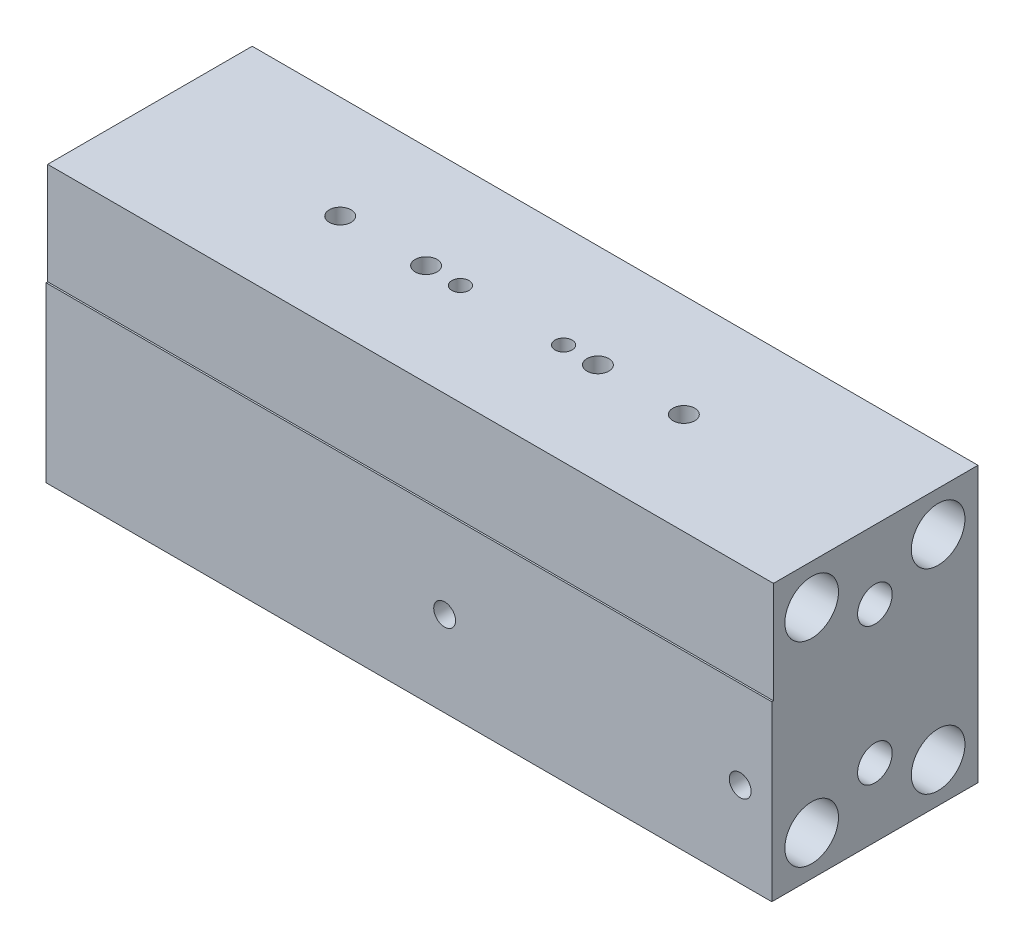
ISO-10303-21;
HEADER;
FILE_DESCRIPTION(('STEP AP214'),'2;1');
FILE_NAME('part.step','',(''),(''),'','','');
FILE_SCHEMA(('AUTOMOTIVE_DESIGN { 1 0 10303 214 1 1 1 1 }'));
ENDSEC;
DATA;
#1=APPLICATION_CONTEXT('core data for automotive mechanical design processes');
#2=APPLICATION_PROTOCOL_DEFINITION('international standard','automotive_design',2000,#1);
#3=PRODUCT_CONTEXT('',#1,'mechanical');
#4=PRODUCT('Part','Part','',(#3));
#5=PRODUCT_RELATED_PRODUCT_CATEGORY('part','',(#4));
#6=PRODUCT_DEFINITION_FORMATION('','',#4);
#7=PRODUCT_DEFINITION_CONTEXT('part definition',#1,'design');
#8=PRODUCT_DEFINITION('design','',#6,#7);
#9=PRODUCT_DEFINITION_SHAPE('','',#8);
#10=(LENGTH_UNIT() NAMED_UNIT(*) SI_UNIT(.MILLI.,.METRE.));
#11=(NAMED_UNIT(*) PLANE_ANGLE_UNIT() SI_UNIT($,.RADIAN.));
#12=(NAMED_UNIT(*) SI_UNIT($,.STERADIAN.) SOLID_ANGLE_UNIT());
#13=UNCERTAINTY_MEASURE_WITH_UNIT(LENGTH_MEASURE(1.E-05),#10,'distance_accuracy_value','');
#14=(GEOMETRIC_REPRESENTATION_CONTEXT(3) GLOBAL_UNCERTAINTY_ASSIGNED_CONTEXT((#13)) GLOBAL_UNIT_ASSIGNED_CONTEXT((#10,
#11,#12)) REPRESENTATION_CONTEXT('',''));
#15=CARTESIAN_POINT('',(0.,0.,0.));
#16=DIRECTION('',(0.,0.,1.));
#17=DIRECTION('',(1.,0.,0.));
#18=AXIS2_PLACEMENT_3D('',#15,#16,#17);
#19=CARTESIAN_POINT('',(-67.056,25.4,19.05));
#20=DIRECTION('',(1.,0.,0.));
#21=DIRECTION('',(0.,0.,-1.));
#22=AXIS2_PLACEMENT_3D('',#19,#20,#21);
#23=PLANE('',#22);
#24=CARTESIAN_POINT('',(-67.056,-12.7,0.));
#25=DIRECTION('',(1.,0.,0.));
#26=DIRECTION('',(0.,0.,-1.));
#27=AXIS2_PLACEMENT_3D('',#24,#25,#26);
#28=CIRCLE('',#27,3.2004);
#29=CARTESIAN_POINT('',(-67.056,-12.7,-3.2004));
#30=VERTEX_POINT('',#29);
#31=EDGE_CURVE('E229',#30,#30,#28,.T.);
#32=ORIENTED_EDGE('',*,*,#31,.T.);
#33=EDGE_LOOP('',(#32));
#34=FACE_BOUND('',#33,.T.);
#35=CARTESIAN_POINT('',(-67.056,12.7,0.));
#36=DIRECTION('',(1.,0.,0.));
#37=DIRECTION('',(0.,0.,-1.));
#38=AXIS2_PLACEMENT_3D('',#35,#36,#37);
#39=CIRCLE('',#38,3.2004);
#40=CARTESIAN_POINT('',(-67.056,12.7,-3.2004));
#41=VERTEX_POINT('',#40);
#42=EDGE_CURVE('E235',#41,#41,#39,.T.);
#43=ORIENTED_EDGE('',*,*,#42,.T.);
#44=EDGE_LOOP('',(#43));
#45=FACE_BOUND('',#44,.T.);
#46=CARTESIAN_POINT('',(-67.056,-18.034,-11.684));
#47=DIRECTION('',(1.,0.,0.));
#48=DIRECTION('',(0.,0.,-1.));
#49=AXIS2_PLACEMENT_3D('',#46,#47,#48);
#50=CIRCLE('',#49,4.953);
#51=CARTESIAN_POINT('',(-67.056,-18.034,-16.637));
#52=VERTEX_POINT('',#51);
#53=EDGE_CURVE('E241',#52,#52,#50,.T.);
#54=ORIENTED_EDGE('',*,*,#53,.T.);
#55=EDGE_LOOP('',(#54));
#56=FACE_BOUND('',#55,.T.);
#57=CARTESIAN_POINT('',(-67.056,-18.034,11.684));
#58=DIRECTION('',(1.,0.,0.));
#59=DIRECTION('',(0.,0.,-1.));
#60=AXIS2_PLACEMENT_3D('',#57,#58,#59);
#61=CIRCLE('',#60,4.953);
#62=CARTESIAN_POINT('',(-67.056,-18.034,6.731));
#63=VERTEX_POINT('',#62);
#64=EDGE_CURVE('E247',#63,#63,#61,.T.);
#65=ORIENTED_EDGE('',*,*,#64,.T.);
#66=EDGE_LOOP('',(#65));
#67=FACE_BOUND('',#66,.T.);
#68=CARTESIAN_POINT('',(-67.056,18.034,-11.684));
#69=DIRECTION('',(1.,0.,0.));
#70=DIRECTION('',(0.,0.,-1.));
#71=AXIS2_PLACEMENT_3D('',#68,#69,#70);
#72=CIRCLE('',#71,4.953);
#73=CARTESIAN_POINT('',(-67.056,18.034,-16.637));
#74=VERTEX_POINT('',#73);
#75=EDGE_CURVE('E253',#74,#74,#72,.T.);
#76=ORIENTED_EDGE('',*,*,#75,.T.);
#77=EDGE_LOOP('',(#76));
#78=FACE_BOUND('',#77,.T.);
#79=CARTESIAN_POINT('',(-67.056,18.034,11.684));
#80=DIRECTION('',(1.,0.,0.));
#81=DIRECTION('',(0.,0.,-1.));
#82=AXIS2_PLACEMENT_3D('',#79,#80,#81);
#83=CIRCLE('',#82,4.953);
#84=CARTESIAN_POINT('',(-67.056,18.034,6.731));
#85=VERTEX_POINT('',#84);
#86=EDGE_CURVE('E259',#85,#85,#83,.T.);
#87=ORIENTED_EDGE('',*,*,#86,.T.);
#88=EDGE_LOOP('',(#87));
#89=FACE_BOUND('',#88,.T.);
#90=DIRECTION('',(0.,0.,-1.));
#91=VECTOR('',#90,1.);
#92=CARTESIAN_POINT('',(-67.056,6.604,19.05));
#93=LINE('',#92,#91);
#94=CARTESIAN_POINT('',(-67.056,6.604,19.05));
#95=VERTEX_POINT('',#94);
#96=CARTESIAN_POINT('',(-67.056,6.604,18.7452));
#97=VERTEX_POINT('',#96);
#98=EDGE_CURVE('E277',#95,#97,#93,.T.);
#99=ORIENTED_EDGE('',*,*,#98,.T.);
#100=DIRECTION('',(0.,1.,0.));
#101=VECTOR('',#100,1.);
#102=CARTESIAN_POINT('',(-67.056,6.604,18.7452));
#103=LINE('',#102,#101);
#104=CARTESIAN_POINT('',(-67.056,25.4,18.7452));
#105=VERTEX_POINT('',#104);
#106=EDGE_CURVE('E280',#97,#105,#103,.T.);
#107=ORIENTED_EDGE('',*,*,#106,.T.);
#108=DIRECTION('',(0.,0.,-1.));
#109=VECTOR('',#108,1.);
#110=CARTESIAN_POINT('',(-67.056,25.4,19.05));
#111=LINE('',#110,#109);
#112=CARTESIAN_POINT('',(-67.056,25.4,-19.05));
#113=VERTEX_POINT('',#112);
#114=EDGE_CURVE('E303',#105,#113,#111,.T.);
#115=ORIENTED_EDGE('',*,*,#114,.T.);
#116=DIRECTION('',(0.,-1.,0.));
#117=VECTOR('',#116,1.);
#118=CARTESIAN_POINT('',(-67.056,25.4,-19.05));
#119=LINE('',#118,#117);
#120=CARTESIAN_POINT('',(-67.056,-25.4,-19.05));
#121=VERTEX_POINT('',#120);
#122=EDGE_CURVE('E291',#113,#121,#119,.T.);
#123=ORIENTED_EDGE('',*,*,#122,.T.);
#124=DIRECTION('',(0.,0.,-1.));
#125=VECTOR('',#124,1.);
#126=CARTESIAN_POINT('',(-67.056,-25.4,19.05));
#127=LINE('',#126,#125);
#128=CARTESIAN_POINT('',(-67.056,-25.4,19.05));
#129=VERTEX_POINT('',#128);
#130=EDGE_CURVE('E319',#129,#121,#127,.T.);
#131=ORIENTED_EDGE('',*,*,#130,.F.);
#132=DIRECTION('',(0.,-1.,0.));
#133=VECTOR('',#132,1.);
#134=CARTESIAN_POINT('',(-67.056,25.4,19.05));
#135=LINE('',#134,#133);
#136=EDGE_CURVE('E295',#95,#129,#135,.T.);
#137=ORIENTED_EDGE('',*,*,#136,.F.);
#138=EDGE_LOOP('',(#99,#107,#115,#123,#131,#137));
#139=FACE_BOUND('',#138,.T.);
#140=ADVANCED_FACE('F38',(#34,#45,#56,#67,#78,#89,#139),#23,.F.);
#141=CARTESIAN_POINT('',(-67.056,-25.4,19.05));
#142=DIRECTION('',(0.,1.,0.));
#143=DIRECTION('',(0.,0.,1.));
#144=AXIS2_PLACEMENT_3D('',#141,#142,#143);
#145=PLANE('',#144);
#146=DIRECTION('',(1.,0.,0.));
#147=VECTOR('',#146,1.);
#148=CARTESIAN_POINT('',(-67.056,-25.4,-19.05));
#149=LINE('',#148,#147);
#150=CARTESIAN_POINT('',(67.056,-25.4,-19.05));
#151=VERTEX_POINT('',#150);
#152=EDGE_CURVE('E306',#121,#151,#149,.T.);
#153=ORIENTED_EDGE('',*,*,#152,.T.);
#154=DIRECTION('',(0.,0.,-1.));
#155=VECTOR('',#154,1.);
#156=CARTESIAN_POINT('',(67.056,-25.4,19.05));
#157=LINE('',#156,#155);
#158=CARTESIAN_POINT('',(67.056,-25.4,19.05));
#159=VERTEX_POINT('',#158);
#160=EDGE_CURVE('E316',#159,#151,#157,.T.);
#161=ORIENTED_EDGE('',*,*,#160,.F.);
#162=DIRECTION('',(1.,0.,0.));
#163=VECTOR('',#162,1.);
#164=CARTESIAN_POINT('',(-67.056,-25.4,19.05));
#165=LINE('',#164,#163);
#166=EDGE_CURVE('E297',#129,#159,#165,.T.);
#167=ORIENTED_EDGE('',*,*,#166,.F.);
#168=ORIENTED_EDGE('',*,*,#130,.T.);
#169=EDGE_LOOP('',(#153,#161,#167,#168));
#170=FACE_BOUND('',#169,.T.);
#171=ADVANCED_FACE('F402',(#170),#145,.F.);
#172=CARTESIAN_POINT('',(67.056,-25.4,19.05));
#173=DIRECTION('',(-1.,0.,0.));
#174=DIRECTION('',(0.,0.,1.));
#175=AXIS2_PLACEMENT_3D('',#172,#173,#174);
#176=PLANE('',#175);
#177=CARTESIAN_POINT('',(67.056,-12.7,0.));
#178=DIRECTION('',(1.,0.,0.));
#179=DIRECTION('',(0.,0.,-1.));
#180=AXIS2_PLACEMENT_3D('',#177,#178,#179);
#181=CIRCLE('',#180,3.2004);
#182=CARTESIAN_POINT('',(67.056,-12.7,-3.2004));
#183=VERTEX_POINT('',#182);
#184=EDGE_CURVE('E228',#183,#183,#181,.T.);
#185=ORIENTED_EDGE('',*,*,#184,.F.);
#186=EDGE_LOOP('',(#185));
#187=FACE_BOUND('',#186,.T.);
#188=CARTESIAN_POINT('',(67.056,12.7,0.));
#189=DIRECTION('',(1.,0.,0.));
#190=DIRECTION('',(0.,0.,-1.));
#191=AXIS2_PLACEMENT_3D('',#188,#189,#190);
#192=CIRCLE('',#191,3.2004);
#193=CARTESIAN_POINT('',(67.056,12.7,-3.2004));
#194=VERTEX_POINT('',#193);
#195=EDGE_CURVE('E232',#194,#194,#192,.T.);
#196=ORIENTED_EDGE('',*,*,#195,.F.);
#197=EDGE_LOOP('',(#196));
#198=FACE_BOUND('',#197,.T.);
#199=CARTESIAN_POINT('',(67.056,-18.034,-11.684));
#200=DIRECTION('',(1.,0.,0.));
#201=DIRECTION('',(0.,0.,-1.));
#202=AXIS2_PLACEMENT_3D('',#199,#200,#201);
#203=CIRCLE('',#202,4.953);
#204=CARTESIAN_POINT('',(67.056,-18.034,-16.637));
#205=VERTEX_POINT('',#204);
#206=EDGE_CURVE('E238',#205,#205,#203,.T.);
#207=ORIENTED_EDGE('',*,*,#206,.F.);
#208=EDGE_LOOP('',(#207));
#209=FACE_BOUND('',#208,.T.);
#210=CARTESIAN_POINT('',(67.056,-18.034,11.684));
#211=DIRECTION('',(1.,0.,0.));
#212=DIRECTION('',(0.,0.,-1.));
#213=AXIS2_PLACEMENT_3D('',#210,#211,#212);
#214=CIRCLE('',#213,4.953);
#215=CARTESIAN_POINT('',(67.056,-18.034,6.731));
#216=VERTEX_POINT('',#215);
#217=EDGE_CURVE('E244',#216,#216,#214,.T.);
#218=ORIENTED_EDGE('',*,*,#217,.F.);
#219=EDGE_LOOP('',(#218));
#220=FACE_BOUND('',#219,.T.);
#221=CARTESIAN_POINT('',(67.056,18.034,-11.684));
#222=DIRECTION('',(1.,0.,0.));
#223=DIRECTION('',(0.,0.,-1.));
#224=AXIS2_PLACEMENT_3D('',#221,#222,#223);
#225=CIRCLE('',#224,4.953);
#226=CARTESIAN_POINT('',(67.056,18.034,-16.637));
#227=VERTEX_POINT('',#226);
#228=EDGE_CURVE('E250',#227,#227,#225,.T.);
#229=ORIENTED_EDGE('',*,*,#228,.F.);
#230=EDGE_LOOP('',(#229));
#231=FACE_BOUND('',#230,.T.);
#232=CARTESIAN_POINT('',(67.056,18.034,11.684));
#233=DIRECTION('',(1.,0.,0.));
#234=DIRECTION('',(0.,0.,-1.));
#235=AXIS2_PLACEMENT_3D('',#232,#233,#234);
#236=CIRCLE('',#235,4.953);
#237=CARTESIAN_POINT('',(67.056,18.034,6.731));
#238=VERTEX_POINT('',#237);
#239=EDGE_CURVE('E256',#238,#238,#236,.T.);
#240=ORIENTED_EDGE('',*,*,#239,.F.);
#241=EDGE_LOOP('',(#240));
#242=FACE_BOUND('',#241,.T.);
#243=DIRECTION('',(0.,0.,-1.));
#244=VECTOR('',#243,1.);
#245=CARTESIAN_POINT('',(67.056,25.4,19.05));
#246=LINE('',#245,#244);
#247=CARTESIAN_POINT('',(67.056,25.4,18.7452));
#248=VERTEX_POINT('',#247);
#249=CARTESIAN_POINT('',(67.056,25.4,-19.05));
#250=VERTEX_POINT('',#249);
#251=EDGE_CURVE('E314',#248,#250,#246,.T.);
#252=ORIENTED_EDGE('',*,*,#251,.F.);
#253=DIRECTION('',(0.,1.,0.));
#254=VECTOR('',#253,1.);
#255=CARTESIAN_POINT('',(67.056,6.604,18.7452));
#256=LINE('',#255,#254);
#257=CARTESIAN_POINT('',(67.056,6.604,18.7452));
#258=VERTEX_POINT('',#257);
#259=EDGE_CURVE('E281',#258,#248,#256,.T.);
#260=ORIENTED_EDGE('',*,*,#259,.F.);
#261=DIRECTION('',(0.,0.,-1.));
#262=VECTOR('',#261,1.);
#263=CARTESIAN_POINT('',(67.056,6.604,19.05));
#264=LINE('',#263,#262);
#265=CARTESIAN_POINT('',(67.056,6.604,19.05));
#266=VERTEX_POINT('',#265);
#267=EDGE_CURVE('E276',#266,#258,#264,.T.);
#268=ORIENTED_EDGE('',*,*,#267,.F.);
#269=DIRECTION('',(0.,1.,0.));
#270=VECTOR('',#269,1.);
#271=CARTESIAN_POINT('',(67.056,-25.4,19.05));
#272=LINE('',#271,#270);
#273=EDGE_CURVE('E300',#159,#266,#272,.T.);
#274=ORIENTED_EDGE('',*,*,#273,.F.);
#275=ORIENTED_EDGE('',*,*,#160,.T.);
#276=DIRECTION('',(0.,1.,0.));
#277=VECTOR('',#276,1.);
#278=CARTESIAN_POINT('',(67.056,-25.4,-19.05));
#279=LINE('',#278,#277);
#280=EDGE_CURVE('E308',#151,#250,#279,.T.);
#281=ORIENTED_EDGE('',*,*,#280,.T.);
#282=EDGE_LOOP('',(#252,#260,#268,#274,#275,#281));
#283=FACE_BOUND('',#282,.T.);
#284=ADVANCED_FACE('F407',(#187,#198,#209,#220,#231,#242,#283),#176,.F.);
#285=CARTESIAN_POINT('',(67.056,25.4,19.05));
#286=DIRECTION('',(0.,-1.,0.));
#287=DIRECTION('',(0.,0.,-1.));
#288=AXIS2_PLACEMENT_3D('',#285,#286,#287);
#289=PLANE('',#288);
#290=CARTESIAN_POINT('',(15.875,25.4,0.));
#291=DIRECTION('',(0.,1.,0.));
#292=DIRECTION('',(0.,0.,1.));
#293=AXIS2_PLACEMENT_3D('',#290,#291,#292);
#294=CIRCLE('',#293,2.01929999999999);
#295=CARTESIAN_POINT('',(15.875,25.4,2.01929999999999));
#296=VERTEX_POINT('',#295);
#297=EDGE_CURVE('E162',#296,#296,#294,.T.);
#298=ORIENTED_EDGE('',*,*,#297,.F.);
#299=EDGE_LOOP('',(#298));
#300=FACE_BOUND('',#299,.T.);
#301=CARTESIAN_POINT('',(-31.75,25.4,0.));
#302=DIRECTION('',(0.,1.,0.));
#303=DIRECTION('',(0.,0.,1.));
#304=AXIS2_PLACEMENT_3D('',#301,#302,#303);
#305=CIRCLE('',#304,2.01929999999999);
#306=CARTESIAN_POINT('',(-31.75,25.4,2.01929999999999));
#307=VERTEX_POINT('',#306);
#308=EDGE_CURVE('E171',#307,#307,#305,.T.);
#309=ORIENTED_EDGE('',*,*,#308,.F.);
#310=EDGE_LOOP('',(#309));
#311=FACE_BOUND('',#310,.T.);
#312=CARTESIAN_POINT('',(-15.875,25.4,0.));
#313=DIRECTION('',(0.,1.,0.));
#314=DIRECTION('',(0.,0.,1.));
#315=AXIS2_PLACEMENT_3D('',#312,#313,#314);
#316=CIRCLE('',#315,2.01929999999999);
#317=CARTESIAN_POINT('',(-15.875,25.4,2.01929999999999));
#318=VERTEX_POINT('',#317);
#319=EDGE_CURVE('E178',#318,#318,#316,.T.);
#320=ORIENTED_EDGE('',*,*,#319,.F.);
#321=EDGE_LOOP('',(#320));
#322=FACE_BOUND('',#321,.T.);
#323=CARTESIAN_POINT('',(31.75,25.4,0.));
#324=DIRECTION('',(0.,1.,0.));
#325=DIRECTION('',(0.,0.,1.));
#326=AXIS2_PLACEMENT_3D('',#323,#324,#325);
#327=CIRCLE('',#326,2.01929999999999);
#328=CARTESIAN_POINT('',(31.75,25.4,2.01929999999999));
#329=VERTEX_POINT('',#328);
#330=EDGE_CURVE('E185',#329,#329,#327,.T.);
#331=ORIENTED_EDGE('',*,*,#330,.F.);
#332=EDGE_LOOP('',(#331));
#333=FACE_BOUND('',#332,.T.);
#334=CARTESIAN_POINT('',(-9.525,25.4,0.));
#335=DIRECTION('',(0.,1.,0.));
#336=DIRECTION('',(0.,0.,1.));
#337=AXIS2_PLACEMENT_3D('',#334,#335,#336);
#338=CIRCLE('',#337,1.58749999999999);
#339=CARTESIAN_POINT('',(-9.525,25.4,1.58749999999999));
#340=VERTEX_POINT('',#339);
#341=EDGE_CURVE('E262',#340,#340,#338,.T.);
#342=ORIENTED_EDGE('',*,*,#341,.F.);
#343=EDGE_LOOP('',(#342));
#344=FACE_BOUND('',#343,.T.);
#345=CARTESIAN_POINT('',(9.525,25.4,0.));
#346=DIRECTION('',(0.,1.,0.));
#347=DIRECTION('',(0.,0.,1.));
#348=AXIS2_PLACEMENT_3D('',#345,#346,#347);
#349=CIRCLE('',#348,1.58749999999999);
#350=CARTESIAN_POINT('',(9.525,25.4,1.58749999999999));
#351=VERTEX_POINT('',#350);
#352=EDGE_CURVE('E270',#351,#351,#349,.T.);
#353=ORIENTED_EDGE('',*,*,#352,.F.);
#354=EDGE_LOOP('',(#353));
#355=FACE_BOUND('',#354,.T.);
#356=ORIENTED_EDGE('',*,*,#114,.F.);
#357=DIRECTION('',(1.,0.,0.));
#358=VECTOR('',#357,1.);
#359=CARTESIAN_POINT('',(-67.056,25.4,18.7452));
#360=LINE('',#359,#358);
#361=EDGE_CURVE('E288',#105,#248,#360,.T.);
#362=ORIENTED_EDGE('',*,*,#361,.T.);
#363=ORIENTED_EDGE('',*,*,#251,.T.);
#364=DIRECTION('',(-1.,0.,0.));
#365=VECTOR('',#364,1.);
#366=CARTESIAN_POINT('',(67.056,25.4,-19.05));
#367=LINE('',#366,#365);
#368=EDGE_CURVE('E298',#250,#113,#367,.T.);
#369=ORIENTED_EDGE('',*,*,#368,.T.);
#370=EDGE_LOOP('',(#356,#362,#363,#369));
#371=FACE_BOUND('',#370,.T.);
#372=ADVANCED_FACE('F441',(#300,#311,#322,#333,#344,#355,#371),#289,.F.);
#373=CARTESIAN_POINT('',(-67.056,-25.4,19.05));
#374=DIRECTION('',(0.,0.,1.));
#375=DIRECTION('',(1.,0.,0.));
#376=AXIS2_PLACEMENT_3D('',#373,#374,#375);
#377=PLANE('',#376);
#378=CARTESIAN_POINT('',(6.604,-9.652,19.05));
#379=DIRECTION('',(0.,0.,1.));
#380=DIRECTION('',(1.,0.,0.));
#381=AXIS2_PLACEMENT_3D('',#378,#379,#380);
#382=CIRCLE('',#381,2.0193);
#383=CARTESIAN_POINT('',(8.6233,-9.652,19.05));
#384=VERTEX_POINT('',#383);
#385=EDGE_CURVE('E192',#384,#384,#382,.T.);
#386=ORIENTED_EDGE('',*,*,#385,.F.);
#387=EDGE_LOOP('',(#386));
#388=FACE_BOUND('',#387,.T.);
#389=CARTESIAN_POINT('',(61.214,-9.652,19.05));
#390=DIRECTION('',(0.,0.,1.));
#391=DIRECTION('',(1.,0.,0.));
#392=AXIS2_PLACEMENT_3D('',#389,#390,#391);
#393=CIRCLE('',#392,2.01929999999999);
#394=CARTESIAN_POINT('',(63.2333,-9.652,19.05));
#395=VERTEX_POINT('',#394);
#396=EDGE_CURVE('E198',#395,#395,#393,.T.);
#397=ORIENTED_EDGE('',*,*,#396,.F.);
#398=EDGE_LOOP('',(#397));
#399=FACE_BOUND('',#398,.T.);
#400=DIRECTION('',(1.,0.,0.));
#401=VECTOR('',#400,1.);
#402=CARTESIAN_POINT('',(-67.056,6.604,19.05));
#403=LINE('',#402,#401);
#404=EDGE_CURVE('E284',#95,#266,#403,.T.);
#405=ORIENTED_EDGE('',*,*,#404,.F.);
#406=ORIENTED_EDGE('',*,*,#136,.T.);
#407=ORIENTED_EDGE('',*,*,#166,.T.);
#408=ORIENTED_EDGE('',*,*,#273,.T.);
#409=EDGE_LOOP('',(#405,#406,#407,#408));
#410=FACE_BOUND('',#409,.T.);
#411=ADVANCED_FACE('F430',(#388,#399,#410),#377,.T.);
#412=CARTESIAN_POINT('',(-67.056,-25.4,-19.05));
#413=DIRECTION('',(0.,0.,1.));
#414=DIRECTION('',(1.,0.,0.));
#415=AXIS2_PLACEMENT_3D('',#412,#413,#414);
#416=PLANE('',#415);
#417=CARTESIAN_POINT('',(31.75,0.,-19.05));
#418=DIRECTION('',(0.,0.,-1.));
#419=DIRECTION('',(-1.,0.,0.));
#420=AXIS2_PLACEMENT_3D('',#417,#418,#419);
#421=CIRCLE('',#420,1.58749999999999);
#422=CARTESIAN_POINT('',(30.1625,0.,-19.05));
#423=VERTEX_POINT('',#422);
#424=EDGE_CURVE('E146',#423,#423,#421,.T.);
#425=ORIENTED_EDGE('',*,*,#424,.F.);
#426=EDGE_LOOP('',(#425));
#427=FACE_BOUND('',#426,.T.);
#428=CARTESIAN_POINT('',(-31.75,0.,-19.05));
#429=DIRECTION('',(0.,0.,-1.));
#430=DIRECTION('',(-1.,0.,0.));
#431=AXIS2_PLACEMENT_3D('',#428,#429,#430);
#432=CIRCLE('',#431,1.58749999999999);
#433=CARTESIAN_POINT('',(-33.3375,0.,-19.05));
#434=VERTEX_POINT('',#433);
#435=EDGE_CURVE('E145',#434,#434,#432,.T.);
#436=ORIENTED_EDGE('',*,*,#435,.F.);
#437=EDGE_LOOP('',(#436));
#438=FACE_BOUND('',#437,.T.);
#439=CARTESIAN_POINT('',(0.,-7.9375,-19.05));
#440=DIRECTION('',(0.,0.,-1.));
#441=DIRECTION('',(-1.,0.,0.));
#442=AXIS2_PLACEMENT_3D('',#439,#440,#441);
#443=CIRCLE('',#442,1.6002);
#444=CARTESIAN_POINT('',(-1.6002,-7.9375,-19.05));
#445=VERTEX_POINT('',#444);
#446=EDGE_CURVE('E156',#445,#445,#443,.T.);
#447=ORIENTED_EDGE('',*,*,#446,.F.);
#448=EDGE_LOOP('',(#447));
#449=FACE_BOUND('',#448,.T.);
#450=CARTESIAN_POINT('',(0.,7.9375,-19.05));
#451=DIRECTION('',(0.,0.,-1.));
#452=DIRECTION('',(-1.,0.,0.));
#453=AXIS2_PLACEMENT_3D('',#450,#451,#452);
#454=CIRCLE('',#453,1.6002);
#455=CARTESIAN_POINT('',(-1.6002,7.9375,-19.05));
#456=VERTEX_POINT('',#455);
#457=EDGE_CURVE('E158',#456,#456,#454,.T.);
#458=ORIENTED_EDGE('',*,*,#457,.F.);
#459=EDGE_LOOP('',(#458));
#460=FACE_BOUND('',#459,.T.);
#461=CARTESIAN_POINT('',(-25.4,7.9375,-19.05));
#462=DIRECTION('',(0.,0.,-1.));
#463=DIRECTION('',(-1.,0.,0.));
#464=AXIS2_PLACEMENT_3D('',#461,#462,#463);
#465=CIRCLE('',#464,1.7272);
#466=CARTESIAN_POINT('',(-27.1272,7.9375,-19.05));
#467=VERTEX_POINT('',#466);
#468=EDGE_CURVE('E204',#467,#467,#465,.T.);
#469=ORIENTED_EDGE('',*,*,#468,.F.);
#470=EDGE_LOOP('',(#469));
#471=FACE_BOUND('',#470,.T.);
#472=CARTESIAN_POINT('',(25.4,7.9375,-19.05));
#473=DIRECTION('',(0.,0.,-1.));
#474=DIRECTION('',(-1.,0.,0.));
#475=AXIS2_PLACEMENT_3D('',#472,#473,#474);
#476=CIRCLE('',#475,1.7272);
#477=CARTESIAN_POINT('',(23.6728,7.9375,-19.05));
#478=VERTEX_POINT('',#477);
#479=EDGE_CURVE('E210',#478,#478,#476,.T.);
#480=ORIENTED_EDGE('',*,*,#479,.F.);
#481=EDGE_LOOP('',(#480));
#482=FACE_BOUND('',#481,.T.);
#483=CARTESIAN_POINT('',(25.4,-7.9375,-19.05));
#484=DIRECTION('',(0.,0.,-1.));
#485=DIRECTION('',(-1.,0.,0.));
#486=AXIS2_PLACEMENT_3D('',#483,#484,#485);
#487=CIRCLE('',#486,1.7272);
#488=CARTESIAN_POINT('',(23.6728,-7.9375,-19.05));
#489=VERTEX_POINT('',#488);
#490=EDGE_CURVE('E216',#489,#489,#487,.T.);
#491=ORIENTED_EDGE('',*,*,#490,.F.);
#492=EDGE_LOOP('',(#491));
#493=FACE_BOUND('',#492,.T.);
#494=CARTESIAN_POINT('',(-25.4,-7.9375,-19.05));
#495=DIRECTION('',(0.,0.,-1.));
#496=DIRECTION('',(-1.,0.,0.));
#497=AXIS2_PLACEMENT_3D('',#494,#495,#496);
#498=CIRCLE('',#497,1.7272);
#499=CARTESIAN_POINT('',(-27.1272,-7.9375,-19.05));
#500=VERTEX_POINT('',#499);
#501=EDGE_CURVE('E222',#500,#500,#498,.T.);
#502=ORIENTED_EDGE('',*,*,#501,.F.);
#503=EDGE_LOOP('',(#502));
#504=FACE_BOUND('',#503,.T.);
#505=ORIENTED_EDGE('',*,*,#122,.F.);
#506=ORIENTED_EDGE('',*,*,#368,.F.);
#507=ORIENTED_EDGE('',*,*,#280,.F.);
#508=ORIENTED_EDGE('',*,*,#152,.F.);
#509=EDGE_LOOP('',(#505,#506,#507,#508));
#510=FACE_BOUND('',#509,.T.);
#511=ADVANCED_FACE('F445',(#427,#438,#449,#460,#471,#482,#493,#504,#510),#416,.F.);
#512=CARTESIAN_POINT('',(-67.056,6.604,18.7452));
#513=DIRECTION('',(0.,0.,-1.));
#514=DIRECTION('',(-1.,0.,0.));
#515=AXIS2_PLACEMENT_3D('',#512,#513,#514);
#516=PLANE('',#515);
#517=ORIENTED_EDGE('',*,*,#259,.T.);
#518=ORIENTED_EDGE('',*,*,#361,.F.);
#519=ORIENTED_EDGE('',*,*,#106,.F.);
#520=DIRECTION('',(1.,0.,0.));
#521=VECTOR('',#520,1.);
#522=CARTESIAN_POINT('',(-67.056,6.604,18.7452));
#523=LINE('',#522,#521);
#524=EDGE_CURVE('E292',#97,#258,#523,.T.);
#525=ORIENTED_EDGE('',*,*,#524,.T.);
#526=EDGE_LOOP('',(#517,#518,#519,#525));
#527=FACE_BOUND('',#526,.T.);
#528=ADVANCED_FACE('F439',(#527),#516,.F.);
#529=CARTESIAN_POINT('',(-67.056,6.604,19.05));
#530=DIRECTION('',(0.,-1.,0.));
#531=DIRECTION('',(0.,0.,-1.));
#532=AXIS2_PLACEMENT_3D('',#529,#530,#531);
#533=PLANE('',#532);
#534=ORIENTED_EDGE('',*,*,#267,.T.);
#535=ORIENTED_EDGE('',*,*,#524,.F.);
#536=ORIENTED_EDGE('',*,*,#98,.F.);
#537=ORIENTED_EDGE('',*,*,#404,.T.);
#538=EDGE_LOOP('',(#534,#535,#536,#537));
#539=FACE_BOUND('',#538,.T.);
#540=ADVANCED_FACE('F427',(#539),#533,.F.);
#541=CARTESIAN_POINT('',(9.525,19.05,0.));
#542=DIRECTION('',(0.,1.,0.));
#543=DIRECTION('',(0.,0.,1.));
#544=AXIS2_PLACEMENT_3D('',#541,#542,#543);
#545=CONICAL_SURFACE('',#544,1.5875,1.02974425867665);
#546=CARTESIAN_POINT('',(9.525,18.0961337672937,0.));
#547=VERTEX_POINT('',#546);
#548=VERTEX_LOOP('',#547);
#549=FACE_BOUND('',#548,.T.);
#550=CARTESIAN_POINT('',(9.525,19.05,0.));
#551=DIRECTION('',(0.,1.,0.));
#552=DIRECTION('',(0.,0.,1.));
#553=AXIS2_PLACEMENT_3D('',#550,#551,#552);
#554=CIRCLE('',#553,1.5875);
#555=CARTESIAN_POINT('',(9.525,19.05,1.5875));
#556=VERTEX_POINT('',#555);
#557=EDGE_CURVE('E273',#556,#556,#554,.T.);
#558=ORIENTED_EDGE('',*,*,#557,.T.);
#559=EDGE_LOOP('',(#558));
#560=FACE_BOUND('',#559,.T.);
#561=ADVANCED_FACE('F503',(#549,#560),#545,.F.);
#562=CARTESIAN_POINT('',(9.525,25.4,0.));
#563=DIRECTION('',(0.,1.,0.));
#564=DIRECTION('',(0.,0.,1.));
#565=AXIS2_PLACEMENT_3D('',#562,#563,#564);
#566=CYLINDRICAL_SURFACE('',#565,1.58749999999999);
#567=ORIENTED_EDGE('',*,*,#557,.F.);
#568=EDGE_LOOP('',(#567));
#569=FACE_BOUND('',#568,.T.);
#570=ORIENTED_EDGE('',*,*,#352,.T.);
#571=EDGE_LOOP('',(#570));
#572=FACE_BOUND('',#571,.T.);
#573=ADVANCED_FACE('F499',(#569,#572),#566,.F.);
#574=CARTESIAN_POINT('',(-9.525,19.05,0.));
#575=DIRECTION('',(0.,1.,0.));
#576=DIRECTION('',(0.,0.,1.));
#577=AXIS2_PLACEMENT_3D('',#574,#575,#576);
#578=CONICAL_SURFACE('',#577,1.5875,1.02974425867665);
#579=CARTESIAN_POINT('',(-9.525,18.0961337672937,0.));
#580=VERTEX_POINT('',#579);
#581=VERTEX_LOOP('',#580);
#582=FACE_BOUND('',#581,.T.);
#583=CARTESIAN_POINT('',(-9.525,19.05,0.));
#584=DIRECTION('',(0.,1.,0.));
#585=DIRECTION('',(0.,0.,1.));
#586=AXIS2_PLACEMENT_3D('',#583,#584,#585);
#587=CIRCLE('',#586,1.5875);
#588=CARTESIAN_POINT('',(-9.525,19.05,1.5875));
#589=VERTEX_POINT('',#588);
#590=EDGE_CURVE('E267',#589,#589,#587,.T.);
#591=ORIENTED_EDGE('',*,*,#590,.T.);
#592=EDGE_LOOP('',(#591));
#593=FACE_BOUND('',#592,.T.);
#594=ADVANCED_FACE('F492',(#582,#593),#578,.F.);
#595=CARTESIAN_POINT('',(-9.525,25.4,0.));
#596=DIRECTION('',(0.,1.,0.));
#597=DIRECTION('',(0.,0.,1.));
#598=AXIS2_PLACEMENT_3D('',#595,#596,#597);
#599=CYLINDRICAL_SURFACE('',#598,1.58749999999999);
#600=ORIENTED_EDGE('',*,*,#590,.F.);
#601=EDGE_LOOP('',(#600));
#602=FACE_BOUND('',#601,.T.);
#603=ORIENTED_EDGE('',*,*,#341,.T.);
#604=EDGE_LOOP('',(#603));
#605=FACE_BOUND('',#604,.T.);
#606=ADVANCED_FACE('F482',(#602,#605),#599,.F.);
#607=CARTESIAN_POINT('',(-67.056,18.034,11.684));
#608=DIRECTION('',(1.,0.,0.));
#609=DIRECTION('',(0.,0.,-1.));
#610=AXIS2_PLACEMENT_3D('',#607,#608,#609);
#611=CYLINDRICAL_SURFACE('',#610,4.953);
#612=ORIENTED_EDGE('',*,*,#86,.F.);
#613=EDGE_LOOP('',(#612));
#614=FACE_BOUND('',#613,.T.);
#615=ORIENTED_EDGE('',*,*,#239,.T.);
#616=EDGE_LOOP('',(#615));
#617=FACE_BOUND('',#616,.T.);
#618=ADVANCED_FACE('F479',(#614,#617),#611,.F.);
#619=CARTESIAN_POINT('',(-67.056,18.034,-11.684));
#620=DIRECTION('',(1.,0.,0.));
#621=DIRECTION('',(0.,0.,-1.));
#622=AXIS2_PLACEMENT_3D('',#619,#620,#621);
#623=CYLINDRICAL_SURFACE('',#622,4.953);
#624=ORIENTED_EDGE('',*,*,#75,.F.);
#625=EDGE_LOOP('',(#624));
#626=FACE_BOUND('',#625,.T.);
#627=ORIENTED_EDGE('',*,*,#228,.T.);
#628=EDGE_LOOP('',(#627));
#629=FACE_BOUND('',#628,.T.);
#630=ADVANCED_FACE('F481',(#626,#629),#623,.F.);
#631=CARTESIAN_POINT('',(-67.056,-18.034,11.684));
#632=DIRECTION('',(1.,0.,0.));
#633=DIRECTION('',(0.,0.,-1.));
#634=AXIS2_PLACEMENT_3D('',#631,#632,#633);
#635=CYLINDRICAL_SURFACE('',#634,4.953);
#636=ORIENTED_EDGE('',*,*,#64,.F.);
#637=EDGE_LOOP('',(#636));
#638=FACE_BOUND('',#637,.T.);
#639=ORIENTED_EDGE('',*,*,#217,.T.);
#640=EDGE_LOOP('',(#639));
#641=FACE_BOUND('',#640,.T.);
#642=ADVANCED_FACE('F489',(#638,#641),#635,.F.);
#643=CARTESIAN_POINT('',(-67.056,-18.034,-11.684));
#644=DIRECTION('',(1.,0.,0.));
#645=DIRECTION('',(0.,0.,-1.));
#646=AXIS2_PLACEMENT_3D('',#643,#644,#645);
#647=CYLINDRICAL_SURFACE('',#646,4.953);
#648=ORIENTED_EDGE('',*,*,#53,.F.);
#649=EDGE_LOOP('',(#648));
#650=FACE_BOUND('',#649,.T.);
#651=ORIENTED_EDGE('',*,*,#206,.T.);
#652=EDGE_LOOP('',(#651));
#653=FACE_BOUND('',#652,.T.);
#654=ADVANCED_FACE('F397',(#650,#653),#647,.F.);
#655=CARTESIAN_POINT('',(-67.056,12.7,0.));
#656=DIRECTION('',(1.,0.,0.));
#657=DIRECTION('',(0.,0.,-1.));
#658=AXIS2_PLACEMENT_3D('',#655,#656,#657);
#659=CYLINDRICAL_SURFACE('',#658,3.2004);
#660=DIRECTION('',(1.,0.,0.));
#661=VECTOR('',#660,1.);
#662=CARTESIAN_POINT('',(-67.056,9.4996,0.));
#663=LINE('',#662,#661);
#664=CARTESIAN_POINT('',(-0.347107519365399,9.4996,0.));
#665=VERTEX_POINT('',#664);
#666=CARTESIAN_POINT('',(0.347107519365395,9.4996,0.));
#667=VERTEX_POINT('',#666);
#668=EDGE_CURVE('E322',#665,#667,#663,.T.);
#669=ORIENTED_EDGE('',*,*,#668,.F.);
#670=CARTESIAN_POINT('',(-0.347107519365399,9.4996,0.));
#671=CARTESIAN_POINT('',(-0.347076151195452,9.49958575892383,-0.0315350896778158));
#672=CARTESIAN_POINT('',(-0.345006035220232,9.50006564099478,-0.0631139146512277));
#673=CARTESIAN_POINT('',(-0.336505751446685,9.50193008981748,-0.126046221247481));
#674=CARTESIAN_POINT('',(-0.33002162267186,9.50332584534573,-0.157392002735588));
#675=CARTESIAN_POINT('',(-0.31237357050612,9.50693946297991,-0.218814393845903));
#676=CARTESIAN_POINT('',(-0.301196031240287,9.50915971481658,-0.248887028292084));
#677=CARTESIAN_POINT('',(-0.273724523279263,9.51417738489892,-0.306460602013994));
#678=CARTESIAN_POINT('',(-0.257457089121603,9.51697178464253,-0.333973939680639));
#679=CARTESIAN_POINT('',(-0.226901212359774,9.52157348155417,-0.374709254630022));
#680=CARTESIAN_POINT('',(-0.214387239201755,9.52333265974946,-0.389271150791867));
#681=CARTESIAN_POINT('',(-0.187259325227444,9.52676422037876,-0.416316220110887));
#682=CARTESIAN_POINT('',(-0.172647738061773,9.52843669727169,-0.428801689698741));
#683=CARTESIAN_POINT('',(-0.144157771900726,9.53124573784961,-0.449046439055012));
#684=CARTESIAN_POINT('',(-0.130601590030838,9.53242483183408,-0.457250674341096));
#685=CARTESIAN_POINT('',(-0.102300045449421,9.53448948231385,-0.471332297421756));
#686=CARTESIAN_POINT('',(-0.0875553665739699,9.53537520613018,-0.477211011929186));
#687=CARTESIAN_POINT('',(-0.0571125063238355,9.53675340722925,-0.486264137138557));
#688=CARTESIAN_POINT('',(-0.0414082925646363,9.53724304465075,-0.489419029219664));
#689=CARTESIAN_POINT('',(-0.0096797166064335,9.53774917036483,-0.492679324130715));
#690=CARTESIAN_POINT('',(0.00634446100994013,9.53776592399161,-0.492786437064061));
#691=CARTESIAN_POINT('',(0.0362299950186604,9.53735139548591,-0.490117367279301));
#692=CARTESIAN_POINT('',(0.0501238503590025,9.53697263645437,-0.487679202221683));
#693=CARTESIAN_POINT('',(0.0773195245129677,9.53588889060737,-0.4805972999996));
#694=CARTESIAN_POINT('',(0.0906212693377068,9.53518386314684,-0.475953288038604));
#695=CARTESIAN_POINT('',(0.116765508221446,9.53348973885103,-0.464550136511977));
#696=CARTESIAN_POINT('',(0.129579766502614,9.53249228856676,-0.45772818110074));
#697=CARTESIAN_POINT('',(0.15410551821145,9.53030990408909,-0.442363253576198));
#698=CARTESIAN_POINT('',(0.165816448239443,9.52912487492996,-0.433819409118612));
#699=CARTESIAN_POINT('',(0.193847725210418,9.52600660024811,-0.41051842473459));
#700=CARTESIAN_POINT('',(0.20939753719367,9.52400476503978,-0.394840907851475));
#701=CARTESIAN_POINT('',(0.237774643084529,9.52000094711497,-0.361186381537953));
#702=CARTESIAN_POINT('',(0.250595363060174,9.51799897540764,-0.343203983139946));
#703=CARTESIAN_POINT('',(0.278051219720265,9.51344111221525,-0.298461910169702));
#704=CARTESIAN_POINT('',(0.291508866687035,9.51096572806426,-0.270973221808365));
#705=CARTESIAN_POINT('',(0.313926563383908,9.50664593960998,-0.214165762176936));
#706=CARTESIAN_POINT('',(0.322877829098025,9.50480276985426,-0.184843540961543));
#707=CARTESIAN_POINT('',(0.335608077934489,9.50212270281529,-0.129573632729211));
#708=CARTESIAN_POINT('',(0.339950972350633,9.50117825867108,-0.103757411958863));
#709=CARTESIAN_POINT('',(0.345683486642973,9.49991605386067,-0.0519556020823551));
#710=CARTESIAN_POINT('',(0.347092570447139,9.49959416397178,-0.0259722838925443));
#711=CARTESIAN_POINT('',(0.347107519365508,9.4996,0.));
#712=B_SPLINE_CURVE_WITH_KNOTS('',3,(#670,#671,#672,#673,#674,#675,#676,#677,#678,#679,#680,
#681,#682,#683,#684,#685,#686,#687,#688,#689,#690,#691,#692,#693,#694,#695,#696,#697,#698,#699,
#700,#701,#702,#703,#704,#705,#706,#707,#708,#709,#710,#711),.UNSPECIFIED.,.F.,.F.,(4,2,2,2,2,2,
2,2,2,2,2,2,2,2,2,2,2,2,2,2,4),(0.,0.0946073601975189,0.190392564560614,0.286457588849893,
0.382029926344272,0.439692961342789,0.497291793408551,0.544771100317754,0.592223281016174,
0.640012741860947,0.687775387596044,0.729914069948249,0.772058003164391,0.815547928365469,
0.859059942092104,0.925202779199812,0.991503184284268,1.08312823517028,1.17493120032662,
1.25334659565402,1.3312400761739),.UNSPECIFIED.);
#713=EDGE_CURVE('E833',#665,#667,#712,.T.);
#714=ORIENTED_EDGE('',*,*,#713,.T.);
#715=EDGE_LOOP('',(#669,#714));
#716=FACE_BOUND('',#715,.T.);
#717=CARTESIAN_POINT('',(15.5211876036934,15.8583364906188,-0.517175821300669));
#718=CARTESIAN_POINT('',(15.485825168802,15.8612855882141,-0.499169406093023));
#719=CARTESIAN_POINT('',(15.4518773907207,15.8645489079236,-0.478290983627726));
#720=CARTESIAN_POINT('',(15.3880065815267,15.8713351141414,-0.43100231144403));
#721=CARTESIAN_POINT('',(15.3580908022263,15.874858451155,-0.404582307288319));
#722=CARTESIAN_POINT('',(15.3084985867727,15.8810994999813,-0.351768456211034));
#723=CARTESIAN_POINT('',(15.2879471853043,15.883849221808,-0.3262019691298));
#724=CARTESIAN_POINT('',(15.2513429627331,15.8889361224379,-0.272001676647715));
#725=CARTESIAN_POINT('',(15.2352852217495,15.8912737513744,-0.243371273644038));
#726=CARTESIAN_POINT('',(15.2083986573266,15.8952794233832,-0.18345327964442));
#727=CARTESIAN_POINT('',(15.1976051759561,15.896942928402,-0.152149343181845));
#728=CARTESIAN_POINT('',(15.1821370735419,15.8993494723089,-0.0880259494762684));
#729=CARTESIAN_POINT('',(15.1774587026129,15.900093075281,-0.0552074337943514));
#730=CARTESIAN_POINT('',(15.1747275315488,15.9005261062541,0.00695648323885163));
#731=CARTESIAN_POINT('',(15.1759818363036,15.9003257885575,0.0362724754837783));
#732=CARTESIAN_POINT('',(15.1834793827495,15.8991435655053,0.0942366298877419));
#733=CARTESIAN_POINT('',(15.1897219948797,15.8981617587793,0.122884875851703));
#734=CARTESIAN_POINT('',(15.2066174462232,15.8955621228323,0.178007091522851));
#735=CARTESIAN_POINT('',(15.2171546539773,15.8939610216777,0.204517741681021));
#736=CARTESIAN_POINT('',(15.2421268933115,15.8902806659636,0.255589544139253));
#737=CARTESIAN_POINT('',(15.2565629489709,15.8882012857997,0.280150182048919));
#738=CARTESIAN_POINT('',(15.2902917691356,15.8835357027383,0.329122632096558));
#739=CARTESIAN_POINT('',(15.3099129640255,15.8809202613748,0.3533046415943));
#740=CARTESIAN_POINT('',(15.3524521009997,15.8755693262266,0.398546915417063));
#741=CARTESIAN_POINT('',(15.3753717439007,15.8728337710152,0.419605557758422));
#742=CARTESIAN_POINT('',(15.4274970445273,15.867059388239,0.461305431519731));
#743=CARTESIAN_POINT('',(15.4571302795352,15.8640362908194,0.481414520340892));
#744=CARTESIAN_POINT('',(15.519057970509,15.8584051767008,0.517071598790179));
#745=CARTESIAN_POINT('',(15.5513538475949,15.8557973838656,0.532617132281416));
#746=CARTESIAN_POINT('',(15.6222887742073,15.8509219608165,0.56078826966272));
#747=CARTESIAN_POINT('',(15.6611995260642,15.8487460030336,0.572748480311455));
#748=CARTESIAN_POINT('',(15.7404422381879,15.8454583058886,0.590536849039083));
#749=CARTESIAN_POINT('',(15.7807746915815,15.8443469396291,0.596362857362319));
#750=CARTESIAN_POINT('',(15.8647478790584,15.8432709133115,0.602012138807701));
#751=CARTESIAN_POINT('',(15.9084209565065,15.8433928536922,0.601382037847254));
#752=CARTESIAN_POINT('',(15.9950655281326,15.844980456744,0.593022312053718));
#753=CARTESIAN_POINT('',(16.0380368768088,15.846446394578,0.585291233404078));
#754=CARTESIAN_POINT('',(16.1225514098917,15.8505681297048,0.562684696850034));
#755=CARTESIAN_POINT('',(16.1640719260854,15.8532376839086,0.54772648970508));
#756=CARTESIAN_POINT('',(16.2438359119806,15.8594320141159,0.510782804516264));
#757=CARTESIAN_POINT('',(16.2820782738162,15.8629570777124,0.488794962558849));
#758=CARTESIAN_POINT('',(16.352153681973,15.870213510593,0.439209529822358));
#759=CARTESIAN_POINT('',(16.38419806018,15.8739283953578,0.411909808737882));
#760=CARTESIAN_POINT('',(16.4423520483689,15.8811735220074,0.351582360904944));
#761=CARTESIAN_POINT('',(16.4684740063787,15.8847041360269,0.31856680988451));
#762=CARTESIAN_POINT('',(16.5068838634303,15.890126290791,0.257518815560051));
#763=CARTESIAN_POINT('',(16.5209991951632,15.8922008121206,0.230645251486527));
#764=CARTESIAN_POINT('',(16.5445944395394,15.8957392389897,0.174894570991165));
#765=CARTESIAN_POINT('',(16.5540780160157,15.8972036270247,0.146019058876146));
#766=CARTESIAN_POINT('',(16.5679035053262,15.8993571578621,0.0868988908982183));
#767=CARTESIAN_POINT('',(16.5722244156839,15.9000431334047,0.0566491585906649));
#768=CARTESIAN_POINT('',(16.5753712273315,15.9005415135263,-0.00414375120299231));
#769=CARTESIAN_POINT('',(16.5741978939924,15.9003540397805,-0.0346868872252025));
#770=CARTESIAN_POINT('',(16.5667060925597,15.899172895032,-0.0929830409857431));
#771=CARTESIAN_POINT('',(16.5607443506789,15.8982351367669,-0.120784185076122));
#772=CARTESIAN_POINT('',(16.5444525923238,15.8957253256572,-0.175037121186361));
#773=CARTESIAN_POINT('',(16.5341220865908,15.8941532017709,-0.201488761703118));
#774=CARTESIAN_POINT('',(16.5091055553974,15.890458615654,-0.253454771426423));
#775=CARTESIAN_POINT('',(16.4942674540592,15.8883173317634,-0.278894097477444));
#776=CARTESIAN_POINT('',(16.4610148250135,15.8837152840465,-0.32727500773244));
#777=CARTESIAN_POINT('',(16.4425988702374,15.8812543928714,-0.350215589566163));
#778=CARTESIAN_POINT('',(16.4001983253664,15.8758856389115,-0.396121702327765));
#779=CARTESIAN_POINT('',(16.3758011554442,15.8729612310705,-0.418703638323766));
#780=CARTESIAN_POINT('',(16.3239795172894,15.8672254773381,-0.460087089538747));
#781=CARTESIAN_POINT('',(16.296553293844,15.8644141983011,-0.478886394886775));
#782=CARTESIAN_POINT('',(16.2350620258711,15.8587392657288,-0.515084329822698));
#783=CARTESIAN_POINT('',(16.2006182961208,15.8559310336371,-0.531849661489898));
#784=CARTESIAN_POINT('',(16.1295669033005,15.8510514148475,-0.560035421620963));
#785=CARTESIAN_POINT('',(16.092958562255,15.8489802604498,-0.571454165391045));
#786=CARTESIAN_POINT('',(16.0145033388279,15.8456057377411,-0.589764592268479));
#787=CARTESIAN_POINT('',(15.972510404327,15.8444060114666,-0.596053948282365));
#788=CARTESIAN_POINT('',(15.8880040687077,15.8432898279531,-0.601911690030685));
#789=CARTESIAN_POINT('',(15.8454901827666,15.8433746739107,-0.601473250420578));
#790=CARTESIAN_POINT('',(15.7593606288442,15.8448497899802,-0.593714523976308));
#791=CARTESIAN_POINT('',(15.715771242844,15.8462934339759,-0.586112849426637));
#792=CARTESIAN_POINT('',(15.6306270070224,15.8503828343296,-0.563716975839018));
#793=CARTESIAN_POINT('',(15.5890663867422,15.8530249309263,-0.548944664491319));
#794=CARTESIAN_POINT('',(15.5397699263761,15.8568163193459,-0.526392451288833));
#795=CARTESIAN_POINT('',(15.5304304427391,15.8575656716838,-0.521882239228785));
#796=CARTESIAN_POINT('',(15.5211876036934,15.8583364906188,-0.517175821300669));
#797=B_SPLINE_CURVE_WITH_KNOTS('',3,(#717,#718,#719,#720,#721,#722,#723,#724,#725,#726,#727,
#728,#729,#730,#731,#732,#733,#734,#735,#736,#737,#738,#739,#740,#741,#742,#743,#744,#745,#746,
#747,#748,#749,#750,#751,#752,#753,#754,#755,#756,#757,#758,#759,#760,#761,#762,#763,#764,#765,
#766,#767,#768,#769,#770,#771,#772,#773,#774,#775,#776,#777,#778,#779,#780,#781,#782,#783,#784,
#785,#786,#787,#788,#789,#790,#791,#792,#793,#794,#795,#796),.UNSPECIFIED.,.T.,.F.,(4,2,2,2,2,2,
2,2,2,2,2,2,2,2,2,2,2,2,2,2,2,2,2,2,2,2,2,2,2,2,2,2,2,2,2,2,2,2,2,4),(0.,0.119350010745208,
0.238911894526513,0.337256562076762,0.435493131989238,0.534380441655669,0.633207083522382,
0.720796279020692,0.808374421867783,0.893735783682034,0.979119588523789,1.07250786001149,
1.1659444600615,1.27333693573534,1.38078710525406,1.50255946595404,1.62437448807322,
1.75479932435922,1.8852508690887,2.01723278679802,2.14925913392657,2.27532854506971,
2.40113263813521,2.49203281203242,2.58286096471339,2.67405737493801,2.76524108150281,
2.85019969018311,2.93516781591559,3.02340007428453,3.11166759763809,3.21139714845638,
3.31118479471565,3.42594359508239,3.54073853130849,3.66760506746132,3.79460031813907,
3.92680179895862,4.05860226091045,4.08979731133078),.UNSPECIFIED.);
#798=CARTESIAN_POINT('',(15.5211876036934,15.8583364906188,-0.517175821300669));
#799=VERTEX_POINT('',#798);
#800=EDGE_CURVE('E170',#799,#799,#797,.T.);
#801=ORIENTED_EDGE('',*,*,#800,.T.);
#802=EDGE_LOOP('',(#801));
#803=FACE_BOUND('',#802,.T.);
#804=CARTESIAN_POINT('',(-32.3428164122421,15.8846668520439,-0.316950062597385));
#805=CARTESIAN_POINT('',(-32.3607793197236,15.887115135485,-0.292350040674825));
#806=CARTESIAN_POINT('',(-32.3768698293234,15.8894114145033,-0.266377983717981));
#807=CARTESIAN_POINT('',(-32.4046396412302,15.8934774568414,-0.212130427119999));
#808=CARTESIAN_POINT('',(-32.4163221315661,15.8952476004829,-0.183856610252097));
#809=CARTESIAN_POINT('',(-32.4350104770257,15.8981182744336,-0.124549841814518));
#810=CARTESIAN_POINT('',(-32.4418192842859,15.8991904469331,-0.0934526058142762));
#811=CARTESIAN_POINT('',(-32.4495442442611,15.9004089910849,-0.030513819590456));
#812=CARTESIAN_POINT('',(-32.4504621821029,15.9005556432,0.00132750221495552));
#813=CARTESIAN_POINT('',(-32.4465524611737,15.8999369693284,0.0614749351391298));
#814=CARTESIAN_POINT('',(-32.4422823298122,15.8992601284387,0.0898200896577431));
#815=CARTESIAN_POINT('',(-32.4291595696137,15.8972166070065,0.145394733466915));
#816=CARTESIAN_POINT('',(-32.4203069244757,15.8958499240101,0.172624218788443));
#817=CARTESIAN_POINT('',(-32.3983036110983,15.8925430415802,0.225717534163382));
#818=CARTESIAN_POINT('',(-32.3850902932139,15.8905945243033,0.251554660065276));
#819=CARTESIAN_POINT('',(-32.3549771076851,15.8863163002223,0.300938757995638));
#820=CARTESIAN_POINT('',(-32.3380759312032,15.8839864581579,0.324484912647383));
#821=CARTESIAN_POINT('',(-32.2989811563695,15.8788514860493,0.371604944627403));
#822=CARTESIAN_POINT('',(-32.2763979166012,15.8760227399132,0.394852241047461));
#823=CARTESIAN_POINT('',(-32.2280989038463,15.8703853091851,0.437821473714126));
#824=CARTESIAN_POINT('',(-32.2023814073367,15.8675766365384,0.457541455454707));
#825=CARTESIAN_POINT('',(-32.144384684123,15.8617987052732,0.496007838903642));
#826=CARTESIAN_POINT('',(-32.1117018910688,15.8588697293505,0.514152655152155));
#827=CARTESIAN_POINT('',(-32.0439619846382,15.8536259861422,0.545393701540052));
#828=CARTESIAN_POINT('',(-32.0089037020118,15.8513115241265,0.558487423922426));
#829=CARTESIAN_POINT('',(-31.933031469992,15.8472904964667,0.58074706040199));
#830=CARTESIAN_POINT('',(-31.8920237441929,15.8456866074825,0.589274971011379));
#831=CARTESIAN_POINT('',(-31.8091490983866,15.8436962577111,0.599801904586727));
#832=CARTESIAN_POINT('',(-31.7672819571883,15.8433101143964,0.601799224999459));
#833=CARTESIAN_POINT('',(-31.6816299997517,15.8438118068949,0.599174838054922));
#834=CARTESIAN_POINT('',(-31.6378554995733,15.8447651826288,0.594212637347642));
#835=CARTESIAN_POINT('',(-31.5517560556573,15.8479493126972,0.577104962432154));
#836=CARTESIAN_POINT('',(-31.5094317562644,15.8501806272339,0.564956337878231));
#837=CARTESIAN_POINT('',(-31.4276605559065,15.8556326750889,0.533660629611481));
#838=CARTESIAN_POINT('',(-31.3882051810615,15.8588503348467,0.514535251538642));
#839=CARTESIAN_POINT('',(-31.3134388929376,15.8658570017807,0.469496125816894));
#840=CARTESIAN_POINT('',(-31.278123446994,15.8696453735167,0.443589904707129));
#841=CARTESIAN_POINT('',(-31.2203513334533,15.8764136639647,0.391764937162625));
#842=CARTESIAN_POINT('',(-31.196772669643,15.8793888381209,0.367092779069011));
#843=CARTESIAN_POINT('',(-31.1539921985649,15.8850540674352,0.314161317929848));
#844=CARTESIAN_POINT('',(-31.1347880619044,15.8877442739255,0.285903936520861));
#845=CARTESIAN_POINT('',(-31.1015887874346,15.8925423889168,0.226133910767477));
#846=CARTESIAN_POINT('',(-31.0876321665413,15.8946459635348,0.194599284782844));
#847=CARTESIAN_POINT('',(-31.0660581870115,15.8979493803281,0.129384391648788));
#848=CARTESIAN_POINT('',(-31.0584347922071,15.8991500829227,0.095706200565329));
#849=CARTESIAN_POINT('',(-31.0506427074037,15.9003797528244,0.0318750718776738));
#850=CARTESIAN_POINT('',(-31.0496429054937,15.9005393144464,0.00182436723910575));
#851=CARTESIAN_POINT('',(-31.0529564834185,15.9000144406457,-0.0579694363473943));
#852=CARTESIAN_POINT('',(-31.0572684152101,15.8993302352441,-0.0877126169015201));
#853=CARTESIAN_POINT('',(-31.0705595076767,15.8972602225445,-0.144393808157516));
#854=CARTESIAN_POINT('',(-31.0792735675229,15.8959143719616,-0.171396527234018));
#855=CARTESIAN_POINT('',(-31.1007703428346,15.8926809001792,-0.223687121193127));
#856=CARTESIAN_POINT('',(-31.1135538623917,15.8907931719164,-0.248974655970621));
#857=CARTESIAN_POINT('',(-31.1437263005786,15.8864948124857,-0.29915113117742));
#858=CARTESIAN_POINT('',(-31.1613838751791,15.8840560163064,-0.323875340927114));
#859=CARTESIAN_POINT('',(-31.2001054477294,15.8789728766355,-0.370461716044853));
#860=CARTESIAN_POINT('',(-31.2211710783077,15.8763284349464,-0.392322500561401));
#861=CARTESIAN_POINT('',(-31.2693235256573,15.8706650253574,-0.435882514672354));
#862=CARTESIAN_POINT('',(-31.2968405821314,15.8676469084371,-0.457106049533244));
#863=CARTESIAN_POINT('',(-31.3546981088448,15.8618976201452,-0.495315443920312));
#864=CARTESIAN_POINT('',(-31.3850401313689,15.8591666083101,-0.512298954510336));
#865=CARTESIAN_POINT('',(-31.4522858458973,15.8538734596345,-0.544001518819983));
#866=CARTESIAN_POINT('',(-31.489509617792,15.8513903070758,-0.558057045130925));
#867=CARTESIAN_POINT('',(-31.5657107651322,15.847362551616,-0.580342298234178));
#868=CARTESIAN_POINT('',(-31.6046888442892,15.8458183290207,-0.588569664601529));
#869=CARTESIAN_POINT('',(-31.6868170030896,15.8437428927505,-0.599563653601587));
#870=CARTESIAN_POINT('',(-31.7300404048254,15.8433087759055,-0.601807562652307));
#871=CARTESIAN_POINT('',(-31.8162800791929,15.8437856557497,-0.599310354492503));
#872=CARTESIAN_POINT('',(-31.8592963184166,15.844696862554,-0.594568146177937));
#873=CARTESIAN_POINT('',(-31.9448955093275,15.8477906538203,-0.57796822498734));
#874=CARTESIAN_POINT('',(-31.9874473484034,15.8500011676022,-0.565954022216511));
#875=CARTESIAN_POINT('',(-32.0698390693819,15.8554392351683,-0.534801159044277));
#876=CARTESIAN_POINT('',(-32.1096771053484,15.8586674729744,-0.515657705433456));
#877=CARTESIAN_POINT('',(-32.1853523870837,15.865728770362,-0.470371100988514));
#878=CARTESIAN_POINT('',(-32.2211723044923,15.8695642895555,-0.444199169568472));
#879=CARTESIAN_POINT('',(-32.286899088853,15.8772616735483,-0.385283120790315));
#880=CARTESIAN_POINT('',(-32.3168187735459,15.8811234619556,-0.352553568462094));
#881=CARTESIAN_POINT('',(-32.3428164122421,15.8846668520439,-0.316950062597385));
#882=B_SPLINE_CURVE_WITH_KNOTS('',3,(#804,#805,#806,#807,#808,#809,#810,#811,#812,#813,#814,
#815,#816,#817,#818,#819,#820,#821,#822,#823,#824,#825,#826,#827,#828,#829,#830,#831,#832,#833,
#834,#835,#836,#837,#838,#839,#840,#841,#842,#843,#844,#845,#846,#847,#848,#849,#850,#851,#852,
#853,#854,#855,#856,#857,#858,#859,#860,#861,#862,#863,#864,#865,#866,#867,#868,#869,#870,#871,
#872,#873,#874,#875,#876,#877,#878,#879,#880,#881),.UNSPECIFIED.,.T.,.F.,(4,2,2,2,2,2,2,2,2,2,2,
2,2,2,2,2,2,2,2,2,2,2,2,2,2,2,2,2,2,2,2,2,2,2,2,2,2,2,4),(0.,0.0915570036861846,
0.183047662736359,0.278055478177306,0.373034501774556,0.458649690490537,0.544265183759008,
0.631168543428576,0.718102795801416,0.815326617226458,0.91260414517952,1.02463978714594,
1.13673098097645,1.26192417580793,1.3871500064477,1.51872064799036,1.65034900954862,
1.78157130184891,1.91264855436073,2.01500423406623,2.11730528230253,2.22034320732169,
2.32328281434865,2.41301225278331,2.50271723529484,2.58756946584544,2.67243847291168,
2.76352106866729,2.85464742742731,2.95888363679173,3.06317746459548,3.18227393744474,
3.30141861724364,3.43067509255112,3.55995175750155,3.69211452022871,3.82436630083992,
3.95716811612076,4.08967817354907),.UNSPECIFIED.);
#883=CARTESIAN_POINT('',(-32.3428164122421,15.8846668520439,-0.316950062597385));
#884=VERTEX_POINT('',#883);
#885=EDGE_CURVE('E177',#884,#884,#882,.T.);
#886=ORIENTED_EDGE('',*,*,#885,.T.);
#887=EDGE_LOOP('',(#886));
#888=FACE_BOUND('',#887,.T.);
#889=CARTESIAN_POINT('',(-16.2288123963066,15.8583364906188,-0.51717582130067));
#890=CARTESIAN_POINT('',(-16.264174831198,15.8612855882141,-0.499169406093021));
#891=CARTESIAN_POINT('',(-16.2981226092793,15.8645489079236,-0.478290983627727));
#892=CARTESIAN_POINT('',(-16.3619934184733,15.8713351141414,-0.431002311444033));
#893=CARTESIAN_POINT('',(-16.3919091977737,15.874858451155,-0.404582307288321));
#894=CARTESIAN_POINT('',(-16.4415014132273,15.8810994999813,-0.351768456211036));
#895=CARTESIAN_POINT('',(-16.4620528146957,15.883849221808,-0.326201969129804));
#896=CARTESIAN_POINT('',(-16.4986570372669,15.8889361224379,-0.272001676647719));
#897=CARTESIAN_POINT('',(-16.5147147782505,15.8912737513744,-0.243371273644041));
#898=CARTESIAN_POINT('',(-16.5416013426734,15.8952794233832,-0.183453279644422));
#899=CARTESIAN_POINT('',(-16.5523948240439,15.896942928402,-0.152149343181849));
#900=CARTESIAN_POINT('',(-16.5678629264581,15.8993494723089,-0.0880259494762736));
#901=CARTESIAN_POINT('',(-16.5725412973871,15.900093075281,-0.0552074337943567));
#902=CARTESIAN_POINT('',(-16.5752724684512,15.9005261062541,0.00695648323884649));
#903=CARTESIAN_POINT('',(-16.5740181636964,15.9003257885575,0.0362724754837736));
#904=CARTESIAN_POINT('',(-16.5665206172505,15.8991435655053,0.0942366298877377));
#905=CARTESIAN_POINT('',(-16.5602780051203,15.8981617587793,0.122884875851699));
#906=CARTESIAN_POINT('',(-16.5433825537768,15.8955621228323,0.178007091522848));
#907=CARTESIAN_POINT('',(-16.5328453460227,15.8939610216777,0.204517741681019));
#908=CARTESIAN_POINT('',(-16.5078731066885,15.8902806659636,0.255589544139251));
#909=CARTESIAN_POINT('',(-16.4934370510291,15.8882012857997,0.280150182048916));
#910=CARTESIAN_POINT('',(-16.4597082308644,15.8835357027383,0.329122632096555));
#911=CARTESIAN_POINT('',(-16.4400870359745,15.8809202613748,0.353304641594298));
#912=CARTESIAN_POINT('',(-16.3975478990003,15.8755693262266,0.398546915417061));
#913=CARTESIAN_POINT('',(-16.3746282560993,15.8728337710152,0.419605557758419));
#914=CARTESIAN_POINT('',(-16.3225029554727,15.867059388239,0.461305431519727));
#915=CARTESIAN_POINT('',(-16.2928697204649,15.8640362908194,0.481414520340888));
#916=CARTESIAN_POINT('',(-16.230942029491,15.8584051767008,0.517071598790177));
#917=CARTESIAN_POINT('',(-16.1986461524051,15.8557973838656,0.532617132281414));
#918=CARTESIAN_POINT('',(-16.1277112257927,15.8509219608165,0.560788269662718));
#919=CARTESIAN_POINT('',(-16.0888004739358,15.8487460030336,0.572748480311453));
#920=CARTESIAN_POINT('',(-16.0095577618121,15.8454583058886,0.590536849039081));
#921=CARTESIAN_POINT('',(-15.9692253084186,15.8443469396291,0.596362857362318));
#922=CARTESIAN_POINT('',(-15.8852521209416,15.8432709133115,0.602012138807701));
#923=CARTESIAN_POINT('',(-15.8415790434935,15.8433928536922,0.601382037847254));
#924=CARTESIAN_POINT('',(-15.7549344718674,15.844980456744,0.593022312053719));
#925=CARTESIAN_POINT('',(-15.7119631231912,15.846446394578,0.58529123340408));
#926=CARTESIAN_POINT('',(-15.6274485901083,15.8505681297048,0.562684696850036));
#927=CARTESIAN_POINT('',(-15.5859280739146,15.8532376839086,0.547726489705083));
#928=CARTESIAN_POINT('',(-15.5061640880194,15.8594320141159,0.510782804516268));
#929=CARTESIAN_POINT('',(-15.4679217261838,15.8629570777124,0.488794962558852));
#930=CARTESIAN_POINT('',(-15.397846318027,15.870213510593,0.439209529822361));
#931=CARTESIAN_POINT('',(-15.36580193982,15.8739283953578,0.411909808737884));
#932=CARTESIAN_POINT('',(-15.3076479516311,15.8811735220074,0.351582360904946));
#933=CARTESIAN_POINT('',(-15.2815259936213,15.8847041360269,0.318566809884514));
#934=CARTESIAN_POINT('',(-15.2431161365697,15.890126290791,0.257518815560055));
#935=CARTESIAN_POINT('',(-15.2290008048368,15.8922008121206,0.230645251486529));
#936=CARTESIAN_POINT('',(-15.2054055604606,15.8957392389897,0.174894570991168));
#937=CARTESIAN_POINT('',(-15.1959219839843,15.8972036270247,0.14601905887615));
#938=CARTESIAN_POINT('',(-15.1820964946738,15.8993571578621,0.0868988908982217));
#939=CARTESIAN_POINT('',(-15.1777755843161,15.9000431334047,0.0566491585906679));
#940=CARTESIAN_POINT('',(-15.1746287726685,15.9005415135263,-0.00414375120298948));
#941=CARTESIAN_POINT('',(-15.1758021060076,15.9003540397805,-0.0346868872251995));
#942=CARTESIAN_POINT('',(-15.1832939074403,15.899172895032,-0.0929830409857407));
#943=CARTESIAN_POINT('',(-15.1892556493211,15.8982351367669,-0.12078418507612));
#944=CARTESIAN_POINT('',(-15.2055474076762,15.8957253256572,-0.175037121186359));
#945=CARTESIAN_POINT('',(-15.2158779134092,15.8941532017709,-0.201488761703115));
#946=CARTESIAN_POINT('',(-15.2408944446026,15.890458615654,-0.25345477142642));
#947=CARTESIAN_POINT('',(-15.2557325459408,15.8883173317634,-0.27889409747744));
#948=CARTESIAN_POINT('',(-15.2889851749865,15.8837152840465,-0.327275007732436));
#949=CARTESIAN_POINT('',(-15.3074011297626,15.8812543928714,-0.35021558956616));
#950=CARTESIAN_POINT('',(-15.3498016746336,15.8758856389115,-0.396121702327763));
#951=CARTESIAN_POINT('',(-15.3741988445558,15.8729612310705,-0.418703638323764));
#952=CARTESIAN_POINT('',(-15.4260204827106,15.8672254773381,-0.460087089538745));
#953=CARTESIAN_POINT('',(-15.453446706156,15.8644141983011,-0.478886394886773));
#954=CARTESIAN_POINT('',(-15.5149379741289,15.8587392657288,-0.515084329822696));
#955=CARTESIAN_POINT('',(-15.5493817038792,15.8559310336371,-0.531849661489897));
#956=CARTESIAN_POINT('',(-15.6204330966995,15.8510514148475,-0.560035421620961));
#957=CARTESIAN_POINT('',(-15.657041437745,15.8489802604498,-0.571454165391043));
#958=CARTESIAN_POINT('',(-15.7354966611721,15.8456057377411,-0.589764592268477));
#959=CARTESIAN_POINT('',(-15.777489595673,15.8444060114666,-0.596053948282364));
#960=CARTESIAN_POINT('',(-15.8619959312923,15.8432898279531,-0.601911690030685));
#961=CARTESIAN_POINT('',(-15.9045098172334,15.8433746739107,-0.601473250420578));
#962=CARTESIAN_POINT('',(-15.9906393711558,15.8448497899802,-0.593714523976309));
#963=CARTESIAN_POINT('',(-16.034228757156,15.8462934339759,-0.586112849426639));
#964=CARTESIAN_POINT('',(-16.1193729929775,15.8503828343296,-0.563716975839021));
#965=CARTESIAN_POINT('',(-16.1609336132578,15.8530249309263,-0.548944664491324));
#966=CARTESIAN_POINT('',(-16.2102300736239,15.8568163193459,-0.526392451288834));
#967=CARTESIAN_POINT('',(-16.2195695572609,15.8575656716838,-0.521882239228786));
#968=CARTESIAN_POINT('',(-16.2288123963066,15.8583364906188,-0.51717582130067));
#969=B_SPLINE_CURVE_WITH_KNOTS('',3,(#889,#890,#891,#892,#893,#894,#895,#896,#897,#898,#899,
#900,#901,#902,#903,#904,#905,#906,#907,#908,#909,#910,#911,#912,#913,#914,#915,#916,#917,#918,
#919,#920,#921,#922,#923,#924,#925,#926,#927,#928,#929,#930,#931,#932,#933,#934,#935,#936,#937,
#938,#939,#940,#941,#942,#943,#944,#945,#946,#947,#948,#949,#950,#951,#952,#953,#954,#955,#956,
#957,#958,#959,#960,#961,#962,#963,#964,#965,#966,#967,#968),.UNSPECIFIED.,.T.,.F.,(4,2,2,2,2,2,
2,2,2,2,2,2,2,2,2,2,2,2,2,2,2,2,2,2,2,2,2,2,2,2,2,2,2,2,2,2,2,2,2,4),(0.,0.119350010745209,
0.238911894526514,0.337256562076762,0.435493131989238,0.534380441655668,0.63320708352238,
0.720796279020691,0.808374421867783,0.893735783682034,0.979119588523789,1.07250786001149,
1.16594446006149,1.27333693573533,1.38078710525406,1.50255946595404,1.62437448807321,
1.75479932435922,1.8852508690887,2.01723278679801,2.14925913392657,2.27532854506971,
2.40113263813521,2.49203281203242,2.58286096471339,2.67405737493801,2.76524108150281,
2.85019969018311,2.93516781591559,3.02340007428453,3.11166759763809,3.21139714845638,
3.31118479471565,3.42594359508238,3.54073853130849,3.66760506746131,3.79460031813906,
3.92680179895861,4.05860226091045,4.08979731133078),.UNSPECIFIED.);
#970=CARTESIAN_POINT('',(-16.2288123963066,15.8583364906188,-0.51717582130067));
#971=VERTEX_POINT('',#970);
#972=EDGE_CURVE('E184',#971,#971,#969,.T.);
#973=ORIENTED_EDGE('',*,*,#972,.T.);
#974=EDGE_LOOP('',(#973));
#975=FACE_BOUND('',#974,.T.);
#976=CARTESIAN_POINT('',(31.1571835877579,15.8846668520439,-0.316950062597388));
#977=CARTESIAN_POINT('',(31.1392206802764,15.887115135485,-0.292350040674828));
#978=CARTESIAN_POINT('',(31.1231301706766,15.8894114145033,-0.266377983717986));
#979=CARTESIAN_POINT('',(31.0953603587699,15.8934774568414,-0.212130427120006));
#980=CARTESIAN_POINT('',(31.0836778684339,15.8952476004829,-0.183856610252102));
#981=CARTESIAN_POINT('',(31.0649895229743,15.8981182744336,-0.124549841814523));
#982=CARTESIAN_POINT('',(31.0581807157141,15.8991904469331,-0.0934526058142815));
#983=CARTESIAN_POINT('',(31.0504557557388,15.9004089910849,-0.0305138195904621));
#984=CARTESIAN_POINT('',(31.0495378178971,15.9005556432,0.00132750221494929));
#985=CARTESIAN_POINT('',(31.0534475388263,15.8999369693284,0.0614749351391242));
#986=CARTESIAN_POINT('',(31.0577176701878,15.8992601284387,0.0898200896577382));
#987=CARTESIAN_POINT('',(31.0708404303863,15.8972166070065,0.145394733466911));
#988=CARTESIAN_POINT('',(31.0796930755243,15.8958499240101,0.172624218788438));
#989=CARTESIAN_POINT('',(31.1016963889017,15.8925430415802,0.225717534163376));
#990=CARTESIAN_POINT('',(31.1149097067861,15.8905945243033,0.251554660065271));
#991=CARTESIAN_POINT('',(31.1450228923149,15.8863163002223,0.300938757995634));
#992=CARTESIAN_POINT('',(31.1619240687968,15.8839864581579,0.32448491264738));
#993=CARTESIAN_POINT('',(31.2010188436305,15.8788514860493,0.371604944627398));
#994=CARTESIAN_POINT('',(31.2236020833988,15.8760227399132,0.394852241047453));
#995=CARTESIAN_POINT('',(31.2719010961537,15.8703853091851,0.437821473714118));
#996=CARTESIAN_POINT('',(31.2976185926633,15.8675766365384,0.457541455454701));
#997=CARTESIAN_POINT('',(31.355615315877,15.8617987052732,0.496007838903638));
#998=CARTESIAN_POINT('',(31.3882981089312,15.8588697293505,0.514152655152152));
#999=CARTESIAN_POINT('',(31.4560380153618,15.8536259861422,0.54539370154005));
#1000=CARTESIAN_POINT('',(31.4910962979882,15.8513115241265,0.558487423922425));
#1001=CARTESIAN_POINT('',(31.566968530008,15.8472904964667,0.580747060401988));
#1002=CARTESIAN_POINT('',(31.6079762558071,15.8456866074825,0.589274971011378));
#1003=CARTESIAN_POINT('',(31.6908509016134,15.8436962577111,0.599801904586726));
#1004=CARTESIAN_POINT('',(31.7327180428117,15.8433101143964,0.601799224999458));
#1005=CARTESIAN_POINT('',(31.8183700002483,15.8438118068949,0.599174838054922));
#1006=CARTESIAN_POINT('',(31.8621445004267,15.8447651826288,0.594212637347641));
#1007=CARTESIAN_POINT('',(31.9482439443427,15.8479493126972,0.577104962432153));
#1008=CARTESIAN_POINT('',(31.9905682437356,15.8501806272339,0.56495633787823));
#1009=CARTESIAN_POINT('',(32.0723394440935,15.8556326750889,0.533660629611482));
#1010=CARTESIAN_POINT('',(32.1117948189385,15.8588503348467,0.514535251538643));
#1011=CARTESIAN_POINT('',(32.1865611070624,15.8658570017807,0.469496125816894));
#1012=CARTESIAN_POINT('',(32.221876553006,15.8696453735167,0.443589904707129));
#1013=CARTESIAN_POINT('',(32.2796486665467,15.8764136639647,0.391764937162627));
#1014=CARTESIAN_POINT('',(32.303227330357,15.8793888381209,0.367092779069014));
#1015=CARTESIAN_POINT('',(32.3460078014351,15.8850540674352,0.31416131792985));
#1016=CARTESIAN_POINT('',(32.3652119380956,15.8877442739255,0.285903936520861));
#1017=CARTESIAN_POINT('',(32.3984112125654,15.8925423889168,0.226133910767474));
#1018=CARTESIAN_POINT('',(32.4123678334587,15.8946459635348,0.194599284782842));
#1019=CARTESIAN_POINT('',(32.4339418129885,15.8979493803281,0.129384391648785));
#1020=CARTESIAN_POINT('',(32.4415652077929,15.8991500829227,0.0957062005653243));
#1021=CARTESIAN_POINT('',(32.4493572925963,15.9003797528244,0.0318750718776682));
#1022=CARTESIAN_POINT('',(32.4503570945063,15.9005393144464,0.00182436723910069));
#1023=CARTESIAN_POINT('',(32.4470435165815,15.9000144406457,-0.0579694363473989));
#1024=CARTESIAN_POINT('',(32.4427315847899,15.8993302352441,-0.0877126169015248));
#1025=CARTESIAN_POINT('',(32.4294404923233,15.8972602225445,-0.14439380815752));
#1026=CARTESIAN_POINT('',(32.4207264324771,15.8959143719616,-0.171396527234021));
#1027=CARTESIAN_POINT('',(32.3992296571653,15.8926809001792,-0.223687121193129));
#1028=CARTESIAN_POINT('',(32.3864461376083,15.8907931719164,-0.248974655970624));
#1029=CARTESIAN_POINT('',(32.3562736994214,15.8864948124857,-0.299151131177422));
#1030=CARTESIAN_POINT('',(32.3386161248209,15.8840560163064,-0.323875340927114));
#1031=CARTESIAN_POINT('',(32.2998945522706,15.8789728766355,-0.370461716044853));
#1032=CARTESIAN_POINT('',(32.2788289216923,15.8763284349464,-0.392322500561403));
#1033=CARTESIAN_POINT('',(32.2306764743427,15.8706650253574,-0.435882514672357));
#1034=CARTESIAN_POINT('',(32.2031594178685,15.8676469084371,-0.457106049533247));
#1035=CARTESIAN_POINT('',(32.1453018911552,15.8618976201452,-0.495315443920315));
#1036=CARTESIAN_POINT('',(32.1149598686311,15.8591666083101,-0.512298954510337));
#1037=CARTESIAN_POINT('',(32.0477141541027,15.8538734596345,-0.544001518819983));
#1038=CARTESIAN_POINT('',(32.010490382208,15.8513903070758,-0.558057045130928));
#1039=CARTESIAN_POINT('',(31.9342892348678,15.847362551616,-0.580342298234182));
#1040=CARTESIAN_POINT('',(31.8953111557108,15.8458183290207,-0.588569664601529));
#1041=CARTESIAN_POINT('',(31.8131829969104,15.8437428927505,-0.599563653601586));
#1042=CARTESIAN_POINT('',(31.7699595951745,15.8433087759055,-0.601807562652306));
#1043=CARTESIAN_POINT('',(31.6837199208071,15.8437856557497,-0.599310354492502));
#1044=CARTESIAN_POINT('',(31.6407036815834,15.844696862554,-0.594568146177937));
#1045=CARTESIAN_POINT('',(31.5551044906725,15.8477906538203,-0.57796822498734));
#1046=CARTESIAN_POINT('',(31.5125526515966,15.8500011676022,-0.565954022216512));
#1047=CARTESIAN_POINT('',(31.4301609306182,15.8554392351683,-0.534801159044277));
#1048=CARTESIAN_POINT('',(31.3903228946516,15.8586674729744,-0.515657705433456));
#1049=CARTESIAN_POINT('',(31.3146476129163,15.865728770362,-0.470371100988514));
#1050=CARTESIAN_POINT('',(31.2788276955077,15.8695642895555,-0.444199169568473));
#1051=CARTESIAN_POINT('',(31.213100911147,15.8772616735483,-0.385283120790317));
#1052=CARTESIAN_POINT('',(31.1831812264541,15.8811234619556,-0.352553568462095));
#1053=CARTESIAN_POINT('',(31.1571835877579,15.8846668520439,-0.316950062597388));
#1054=B_SPLINE_CURVE_WITH_KNOTS('',3,(#976,#977,#978,#979,#980,#981,#982,#983,#984,#985,#986,
#987,#988,#989,#990,#991,#992,#993,#994,#995,#996,#997,#998,#999,#1000,#1001,#1002,#1003,#1004,
#1005,#1006,#1007,#1008,#1009,#1010,#1011,#1012,#1013,#1014,#1015,#1016,#1017,#1018,#1019,#1020,
#1021,#1022,#1023,#1024,#1025,#1026,#1027,#1028,#1029,#1030,#1031,#1032,#1033,#1034,#1035,#1036,
#1037,#1038,#1039,#1040,#1041,#1042,#1043,#1044,#1045,#1046,#1047,#1048,#1049,#1050,#1051,#1052,
#1053),.UNSPECIFIED.,.T.,.F.,(4,2,2,2,2,2,2,2,2,2,2,2,2,2,2,2,2,2,2,2,2,2,2,2,2,2,2,2,2,2,2,2,2,
2,2,2,2,2,4),(0.,0.0915570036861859,0.183047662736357,0.278055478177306,0.373034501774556,
0.458649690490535,0.54426518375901,0.631168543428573,0.718102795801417,0.815326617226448,
0.912604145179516,1.02463978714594,1.13673098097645,1.26192417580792,1.3871500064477,
1.51872064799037,1.65034900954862,1.78157130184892,1.91264855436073,2.01500423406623,
2.11730528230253,2.22034320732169,2.32328281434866,2.41301225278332,2.50271723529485,
2.58756946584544,2.67243847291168,2.7635210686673,2.85464742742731,2.95888363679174,
3.0631774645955,3.18227393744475,3.30141861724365,3.43067509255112,3.55995175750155,
3.6921145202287,3.82436630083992,3.95716811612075,4.08967817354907),.UNSPECIFIED.);
#1055=CARTESIAN_POINT('',(31.1571835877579,15.8846668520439,-0.316950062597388));
#1056=VERTEX_POINT('',#1055);
#1057=EDGE_CURVE('E191',#1056,#1056,#1054,.T.);
#1058=ORIENTED_EDGE('',*,*,#1057,.T.);
#1059=EDGE_LOOP('',(#1058));
#1060=FACE_BOUND('',#1059,.T.);
#1061=ORIENTED_EDGE('',*,*,#42,.F.);
#1062=EDGE_LOOP('',(#1061));
#1063=FACE_BOUND('',#1062,.T.);
#1064=ORIENTED_EDGE('',*,*,#195,.T.);
#1065=EDGE_LOOP('',(#1064));
#1066=FACE_BOUND('',#1065,.T.);
#1067=ADVANCED_FACE('F333',(#716,#803,#888,#975,#1060,#1063,#1066),#659,.F.);
#1068=CARTESIAN_POINT('',(-67.056,-12.7,0.));
#1069=DIRECTION('',(1.,0.,0.));
#1070=DIRECTION('',(0.,0.,-1.));
#1071=AXIS2_PLACEMENT_3D('',#1068,#1069,#1070);
#1072=CYLINDRICAL_SURFACE('',#1071,3.2004);
#1073=DIRECTION('',(1.,0.,0.));
#1074=VECTOR('',#1073,1.);
#1075=CARTESIAN_POINT('',(-67.056,-9.4996,0.));
#1076=LINE('',#1075,#1074);
#1077=CARTESIAN_POINT('',(0.347107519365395,-9.4996,0.));
#1078=VERTEX_POINT('',#1077);
#1079=CARTESIAN_POINT('',(-0.347107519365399,-9.4996,0.));
#1080=VERTEX_POINT('',#1079);
#1081=EDGE_CURVE('E50',#1078,#1080,#1076,.F.);
#1082=ORIENTED_EDGE('',*,*,#1081,.F.);
#1083=CARTESIAN_POINT('',(0.347107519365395,-9.4996,0.));
#1084=CARTESIAN_POINT('',(0.347076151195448,-9.49958575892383,-0.0315350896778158));
#1085=CARTESIAN_POINT('',(0.345006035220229,-9.50006564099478,-0.0631139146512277));
#1086=CARTESIAN_POINT('',(0.336505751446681,-9.50193008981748,-0.126046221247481));
#1087=CARTESIAN_POINT('',(0.330021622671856,-9.50332584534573,-0.157392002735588));
#1088=CARTESIAN_POINT('',(0.312373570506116,-9.50693946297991,-0.218814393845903));
#1089=CARTESIAN_POINT('',(0.301196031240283,-9.50915971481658,-0.248887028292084));
#1090=CARTESIAN_POINT('',(0.273724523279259,-9.51417738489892,-0.306460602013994));
#1091=CARTESIAN_POINT('',(0.257457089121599,-9.51697178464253,-0.333973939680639));
#1092=CARTESIAN_POINT('',(0.22690121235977,-9.52157348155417,-0.374709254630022));
#1093=CARTESIAN_POINT('',(0.214387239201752,-9.52333265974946,-0.389271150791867));
#1094=CARTESIAN_POINT('',(0.18725932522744,-9.52676422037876,-0.416316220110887));
#1095=CARTESIAN_POINT('',(0.172647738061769,-9.52843669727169,-0.428801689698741));
#1096=CARTESIAN_POINT('',(0.144157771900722,-9.53124573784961,-0.449046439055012));
#1097=CARTESIAN_POINT('',(0.130601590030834,-9.53242483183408,-0.457250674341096));
#1098=CARTESIAN_POINT('',(0.102300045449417,-9.53448948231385,-0.471332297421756));
#1099=CARTESIAN_POINT('',(0.087555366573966,-9.53537520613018,-0.477211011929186));
#1100=CARTESIAN_POINT('',(0.0571125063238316,-9.53675340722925,-0.486264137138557));
#1101=CARTESIAN_POINT('',(0.0414082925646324,-9.53724304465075,-0.489419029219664));
#1102=CARTESIAN_POINT('',(0.0096797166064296,-9.53774917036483,-0.492679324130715));
#1103=CARTESIAN_POINT('',(-0.00634446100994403,-9.53776592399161,-0.492786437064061));
#1104=CARTESIAN_POINT('',(-0.0362299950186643,-9.53735139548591,-0.490117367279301));
#1105=CARTESIAN_POINT('',(-0.0501238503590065,-9.53697263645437,-0.487679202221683));
#1106=CARTESIAN_POINT('',(-0.0773195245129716,-9.53588889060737,-0.4805972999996));
#1107=CARTESIAN_POINT('',(-0.0906212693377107,-9.53518386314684,-0.475953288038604));
#1108=CARTESIAN_POINT('',(-0.11676550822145,-9.53348973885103,-0.464550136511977));
#1109=CARTESIAN_POINT('',(-0.129579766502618,-9.53249228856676,-0.45772818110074));
#1110=CARTESIAN_POINT('',(-0.154105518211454,-9.53030990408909,-0.442363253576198));
#1111=CARTESIAN_POINT('',(-0.165816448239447,-9.52912487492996,-0.433819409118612));
#1112=CARTESIAN_POINT('',(-0.193847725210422,-9.52600660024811,-0.41051842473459));
#1113=CARTESIAN_POINT('',(-0.209397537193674,-9.52400476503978,-0.394840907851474));
#1114=CARTESIAN_POINT('',(-0.237774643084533,-9.52000094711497,-0.361186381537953));
#1115=CARTESIAN_POINT('',(-0.250595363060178,-9.51799897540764,-0.343203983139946));
#1116=CARTESIAN_POINT('',(-0.278051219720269,-9.51344111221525,-0.298461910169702));
#1117=CARTESIAN_POINT('',(-0.291508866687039,-9.51096572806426,-0.270973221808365));
#1118=CARTESIAN_POINT('',(-0.313926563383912,-9.50664593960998,-0.214165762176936));
#1119=CARTESIAN_POINT('',(-0.322877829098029,-9.50480276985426,-0.184843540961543));
#1120=CARTESIAN_POINT('',(-0.335608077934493,-9.50212270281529,-0.129573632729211));
#1121=CARTESIAN_POINT('',(-0.339950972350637,-9.50117825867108,-0.103757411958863));
#1122=CARTESIAN_POINT('',(-0.345683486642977,-9.49991605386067,-0.051955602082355));
#1123=CARTESIAN_POINT('',(-0.347092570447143,-9.49959416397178,-0.0259722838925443));
#1124=CARTESIAN_POINT('',(-0.347107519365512,-9.4996,0.));
#1125=B_SPLINE_CURVE_WITH_KNOTS('',3,(#1083,#1084,#1085,#1086,#1087,#1088,#1089,#1090,#1091,
#1092,#1093,#1094,#1095,#1096,#1097,#1098,#1099,#1100,#1101,#1102,#1103,#1104,#1105,#1106,#1107,
#1108,#1109,#1110,#1111,#1112,#1113,#1114,#1115,#1116,#1117,#1118,#1119,#1120,#1121,#1122,#1123,
#1124),.UNSPECIFIED.,.F.,.F.,(4,2,2,2,2,2,2,2,2,2,2,2,2,2,2,2,2,2,2,2,4),(0.,0.0946073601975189,
0.190392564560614,0.286457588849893,0.382029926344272,0.439692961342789,0.497291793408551,
0.544771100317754,0.592223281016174,0.640012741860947,0.687775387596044,0.729914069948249,
0.772058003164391,0.815547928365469,0.859059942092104,0.925202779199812,0.991503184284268,
1.08312823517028,1.17493120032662,1.25334659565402,1.3312400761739),.UNSPECIFIED.);
#1126=EDGE_CURVE('E11',#1078,#1080,#1125,.T.);
#1127=ORIENTED_EDGE('',*,*,#1126,.T.);
#1128=EDGE_LOOP('',(#1082,#1127));
#1129=FACE_BOUND('',#1128,.T.);
#1130=ORIENTED_EDGE('',*,*,#31,.F.);
#1131=EDGE_LOOP('',(#1130));
#1132=FACE_BOUND('',#1131,.T.);
#1133=ORIENTED_EDGE('',*,*,#184,.T.);
#1134=EDGE_LOOP('',(#1133));
#1135=FACE_BOUND('',#1134,.T.);
#1136=ADVANCED_FACE('F389',(#1129,#1132,#1135),#1072,.F.);
#1137=CARTESIAN_POINT('',(-25.4,-7.9375,-11.9126));
#1138=DIRECTION('',(0.,0.,-1.));
#1139=DIRECTION('',(-1.,0.,0.));
#1140=AXIS2_PLACEMENT_3D('',#1137,#1138,#1139);
#1141=CONICAL_SURFACE('',#1140,1.7272,1.0471975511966);
#1142=CARTESIAN_POINT('',(-25.4,-7.9375,-10.9154006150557));
#1143=VERTEX_POINT('',#1142);
#1144=VERTEX_LOOP('',#1143);
#1145=FACE_BOUND('',#1144,.T.);
#1146=CARTESIAN_POINT('',(-25.4,-7.9375,-11.9126));
#1147=DIRECTION('',(0.,0.,-1.));
#1148=DIRECTION('',(-1.,0.,0.));
#1149=AXIS2_PLACEMENT_3D('',#1146,#1147,#1148);
#1150=CIRCLE('',#1149,1.7272);
#1151=CARTESIAN_POINT('',(-27.1272,-7.9375,-11.9126));
#1152=VERTEX_POINT('',#1151);
#1153=EDGE_CURVE('E225',#1152,#1152,#1150,.T.);
#1154=ORIENTED_EDGE('',*,*,#1153,.T.);
#1155=EDGE_LOOP('',(#1154));
#1156=FACE_BOUND('',#1155,.T.);
#1157=ADVANCED_FACE('F386',(#1145,#1156),#1141,.F.);
#1158=CARTESIAN_POINT('',(-25.4,-7.9375,-19.05));
#1159=DIRECTION('',(0.,0.,-1.));
#1160=DIRECTION('',(-1.,0.,0.));
#1161=AXIS2_PLACEMENT_3D('',#1158,#1159,#1160);
#1162=CYLINDRICAL_SURFACE('',#1161,1.7272);
#1163=ORIENTED_EDGE('',*,*,#1153,.F.);
#1164=EDGE_LOOP('',(#1163));
#1165=FACE_BOUND('',#1164,.T.);
#1166=ORIENTED_EDGE('',*,*,#501,.T.);
#1167=EDGE_LOOP('',(#1166));
#1168=FACE_BOUND('',#1167,.T.);
#1169=ADVANCED_FACE('F382',(#1165,#1168),#1162,.F.);
#1170=CARTESIAN_POINT('',(25.4,-7.9375,-11.9126));
#1171=DIRECTION('',(0.,0.,-1.));
#1172=DIRECTION('',(-1.,0.,0.));
#1173=AXIS2_PLACEMENT_3D('',#1170,#1171,#1172);
#1174=CONICAL_SURFACE('',#1173,1.7272,1.0471975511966);
#1175=CARTESIAN_POINT('',(25.4,-7.9375,-10.9154006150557));
#1176=VERTEX_POINT('',#1175);
#1177=VERTEX_LOOP('',#1176);
#1178=FACE_BOUND('',#1177,.T.);
#1179=CARTESIAN_POINT('',(25.4,-7.9375,-11.9126));
#1180=DIRECTION('',(0.,0.,-1.));
#1181=DIRECTION('',(-1.,0.,0.));
#1182=AXIS2_PLACEMENT_3D('',#1179,#1180,#1181);
#1183=CIRCLE('',#1182,1.7272);
#1184=CARTESIAN_POINT('',(23.6728,-7.9375,-11.9126));
#1185=VERTEX_POINT('',#1184);
#1186=EDGE_CURVE('E219',#1185,#1185,#1183,.T.);
#1187=ORIENTED_EDGE('',*,*,#1186,.T.);
#1188=EDGE_LOOP('',(#1187));
#1189=FACE_BOUND('',#1188,.T.);
#1190=ADVANCED_FACE('F378',(#1178,#1189),#1174,.F.);
#1191=CARTESIAN_POINT('',(25.4,-7.9375,-19.05));
#1192=DIRECTION('',(0.,0.,-1.));
#1193=DIRECTION('',(-1.,0.,0.));
#1194=AXIS2_PLACEMENT_3D('',#1191,#1192,#1193);
#1195=CYLINDRICAL_SURFACE('',#1194,1.7272);
#1196=ORIENTED_EDGE('',*,*,#1186,.F.);
#1197=EDGE_LOOP('',(#1196));
#1198=FACE_BOUND('',#1197,.T.);
#1199=ORIENTED_EDGE('',*,*,#490,.T.);
#1200=EDGE_LOOP('',(#1199));
#1201=FACE_BOUND('',#1200,.T.);
#1202=ADVANCED_FACE('F374',(#1198,#1201),#1195,.F.);
#1203=CARTESIAN_POINT('',(25.4,7.9375,-11.9126));
#1204=DIRECTION('',(0.,0.,-1.));
#1205=DIRECTION('',(-1.,0.,0.));
#1206=AXIS2_PLACEMENT_3D('',#1203,#1204,#1205);
#1207=CONICAL_SURFACE('',#1206,1.7272,1.0471975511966);
#1208=CARTESIAN_POINT('',(25.4,7.9375,-10.9154006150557));
#1209=VERTEX_POINT('',#1208);
#1210=VERTEX_LOOP('',#1209);
#1211=FACE_BOUND('',#1210,.T.);
#1212=CARTESIAN_POINT('',(25.4,7.9375,-11.9126));
#1213=DIRECTION('',(0.,0.,-1.));
#1214=DIRECTION('',(-1.,0.,0.));
#1215=AXIS2_PLACEMENT_3D('',#1212,#1213,#1214);
#1216=CIRCLE('',#1215,1.7272);
#1217=CARTESIAN_POINT('',(23.6728,7.9375,-11.9126));
#1218=VERTEX_POINT('',#1217);
#1219=EDGE_CURVE('E213',#1218,#1218,#1216,.T.);
#1220=ORIENTED_EDGE('',*,*,#1219,.T.);
#1221=EDGE_LOOP('',(#1220));
#1222=FACE_BOUND('',#1221,.T.);
#1223=ADVANCED_FACE('F370',(#1211,#1222),#1207,.F.);
#1224=CARTESIAN_POINT('',(25.4,7.9375,-19.05));
#1225=DIRECTION('',(0.,0.,-1.));
#1226=DIRECTION('',(-1.,0.,0.));
#1227=AXIS2_PLACEMENT_3D('',#1224,#1225,#1226);
#1228=CYLINDRICAL_SURFACE('',#1227,1.7272);
#1229=ORIENTED_EDGE('',*,*,#1219,.F.);
#1230=EDGE_LOOP('',(#1229));
#1231=FACE_BOUND('',#1230,.T.);
#1232=ORIENTED_EDGE('',*,*,#479,.T.);
#1233=EDGE_LOOP('',(#1232));
#1234=FACE_BOUND('',#1233,.T.);
#1235=ADVANCED_FACE('F366',(#1231,#1234),#1228,.F.);
#1236=CARTESIAN_POINT('',(-25.4,7.9375,-11.9126));
#1237=DIRECTION('',(0.,0.,-1.));
#1238=DIRECTION('',(-1.,0.,0.));
#1239=AXIS2_PLACEMENT_3D('',#1236,#1237,#1238);
#1240=CONICAL_SURFACE('',#1239,1.7272,1.0471975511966);
#1241=CARTESIAN_POINT('',(-25.4,7.9375,-10.9154006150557));
#1242=VERTEX_POINT('',#1241);
#1243=VERTEX_LOOP('',#1242);
#1244=FACE_BOUND('',#1243,.T.);
#1245=CARTESIAN_POINT('',(-25.4,7.9375,-11.9126));
#1246=DIRECTION('',(0.,0.,-1.));
#1247=DIRECTION('',(-1.,0.,0.));
#1248=AXIS2_PLACEMENT_3D('',#1245,#1246,#1247);
#1249=CIRCLE('',#1248,1.7272);
#1250=CARTESIAN_POINT('',(-27.1272,7.9375,-11.9126));
#1251=VERTEX_POINT('',#1250);
#1252=EDGE_CURVE('E207',#1251,#1251,#1249,.T.);
#1253=ORIENTED_EDGE('',*,*,#1252,.T.);
#1254=EDGE_LOOP('',(#1253));
#1255=FACE_BOUND('',#1254,.T.);
#1256=ADVANCED_FACE('F362',(#1244,#1255),#1240,.F.);
#1257=CARTESIAN_POINT('',(-25.4,7.9375,-19.05));
#1258=DIRECTION('',(0.,0.,-1.));
#1259=DIRECTION('',(-1.,0.,0.));
#1260=AXIS2_PLACEMENT_3D('',#1257,#1258,#1259);
#1261=CYLINDRICAL_SURFACE('',#1260,1.7272);
#1262=ORIENTED_EDGE('',*,*,#1252,.F.);
#1263=EDGE_LOOP('',(#1262));
#1264=FACE_BOUND('',#1263,.T.);
#1265=ORIENTED_EDGE('',*,*,#468,.T.);
#1266=EDGE_LOOP('',(#1265));
#1267=FACE_BOUND('',#1266,.T.);
#1268=ADVANCED_FACE('F358',(#1264,#1267),#1261,.F.);
#1269=CARTESIAN_POINT('',(61.214,-9.652,7.0104));
#1270=DIRECTION('',(0.,0.,1.));
#1271=DIRECTION('',(1.,0.,0.));
#1272=AXIS2_PLACEMENT_3D('',#1269,#1270,#1271);
#1273=CONICAL_SURFACE('',#1272,2.01929999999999,1.0471975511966);
#1274=CARTESIAN_POINT('',(61.214,-9.652,5.84455660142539));
#1275=VERTEX_POINT('',#1274);
#1276=VERTEX_LOOP('',#1275);
#1277=FACE_BOUND('',#1276,.T.);
#1278=CARTESIAN_POINT('',(61.214,-9.652,7.0104));
#1279=DIRECTION('',(0.,0.,1.));
#1280=DIRECTION('',(1.,0.,0.));
#1281=AXIS2_PLACEMENT_3D('',#1278,#1279,#1280);
#1282=CIRCLE('',#1281,2.01929999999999);
#1283=CARTESIAN_POINT('',(63.2333,-9.652,7.0104));
#1284=VERTEX_POINT('',#1283);
#1285=EDGE_CURVE('E201',#1284,#1284,#1282,.T.);
#1286=ORIENTED_EDGE('',*,*,#1285,.T.);
#1287=EDGE_LOOP('',(#1286));
#1288=FACE_BOUND('',#1287,.T.);
#1289=ADVANCED_FACE('F354',(#1277,#1288),#1273,.F.);
#1290=CARTESIAN_POINT('',(61.214,-9.652,19.05));
#1291=DIRECTION('',(0.,0.,1.));
#1292=DIRECTION('',(1.,0.,0.));
#1293=AXIS2_PLACEMENT_3D('',#1290,#1291,#1292);
#1294=CYLINDRICAL_SURFACE('',#1293,2.01929999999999);
#1295=ORIENTED_EDGE('',*,*,#1285,.F.);
#1296=EDGE_LOOP('',(#1295));
#1297=FACE_BOUND('',#1296,.T.);
#1298=ORIENTED_EDGE('',*,*,#396,.T.);
#1299=EDGE_LOOP('',(#1298));
#1300=FACE_BOUND('',#1299,.T.);
#1301=ADVANCED_FACE('F350',(#1297,#1300),#1294,.F.);
#1302=CARTESIAN_POINT('',(6.604,-9.652,7.0104));
#1303=DIRECTION('',(0.,0.,1.));
#1304=DIRECTION('',(1.,0.,0.));
#1305=AXIS2_PLACEMENT_3D('',#1302,#1303,#1304);
#1306=CONICAL_SURFACE('',#1305,2.0193,1.0471975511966);
#1307=CARTESIAN_POINT('',(6.604,-9.652,5.84455660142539));
#1308=VERTEX_POINT('',#1307);
#1309=VERTEX_LOOP('',#1308);
#1310=FACE_BOUND('',#1309,.T.);
#1311=CARTESIAN_POINT('',(6.604,-9.652,7.0104));
#1312=DIRECTION('',(0.,0.,1.));
#1313=DIRECTION('',(1.,0.,0.));
#1314=AXIS2_PLACEMENT_3D('',#1311,#1312,#1313);
#1315=CIRCLE('',#1314,2.0193);
#1316=CARTESIAN_POINT('',(8.6233,-9.652,7.0104));
#1317=VERTEX_POINT('',#1316);
#1318=EDGE_CURVE('E195',#1317,#1317,#1315,.T.);
#1319=ORIENTED_EDGE('',*,*,#1318,.T.);
#1320=EDGE_LOOP('',(#1319));
#1321=FACE_BOUND('',#1320,.T.);
#1322=ADVANCED_FACE('F346',(#1310,#1321),#1306,.F.);
#1323=CARTESIAN_POINT('',(6.604,-9.652,19.05));
#1324=DIRECTION('',(0.,0.,1.));
#1325=DIRECTION('',(1.,0.,0.));
#1326=AXIS2_PLACEMENT_3D('',#1323,#1324,#1325);
#1327=CYLINDRICAL_SURFACE('',#1326,2.0193);
#1328=ORIENTED_EDGE('',*,*,#1318,.F.);
#1329=EDGE_LOOP('',(#1328));
#1330=FACE_BOUND('',#1329,.T.);
#1331=ORIENTED_EDGE('',*,*,#385,.T.);
#1332=EDGE_LOOP('',(#1331));
#1333=FACE_BOUND('',#1332,.T.);
#1334=ADVANCED_FACE('F342',(#1330,#1333),#1327,.F.);
#1335=CARTESIAN_POINT('',(31.75,16.6624,0.));
#1336=DIRECTION('',(0.,1.,0.));
#1337=DIRECTION('',(0.,0.,1.));
#1338=AXIS2_PLACEMENT_3D('',#1335,#1336,#1337);
#1339=CONICAL_SURFACE('',#1338,2.01929999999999,1.0471975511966);
#1340=CARTESIAN_POINT('',(31.75,16.6624,0.));
#1341=DIRECTION('',(0.,1.,0.));
#1342=DIRECTION('',(0.,0.,1.));
#1343=AXIS2_PLACEMENT_3D('',#1340,#1341,#1342);
#1344=CIRCLE('',#1343,2.01929999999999);
#1345=CARTESIAN_POINT('',(31.75,16.6624,2.01929999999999));
#1346=VERTEX_POINT('',#1345);
#1347=EDGE_CURVE('E188',#1346,#1346,#1344,.T.);
#1348=ORIENTED_EDGE('',*,*,#1347,.T.);
#1349=EDGE_LOOP('',(#1348));
#1350=FACE_BOUND('',#1349,.T.);
#1351=ORIENTED_EDGE('',*,*,#1057,.F.);
#1352=EDGE_LOOP('',(#1351));
#1353=FACE_BOUND('',#1352,.T.);
#1354=ADVANCED_FACE('F336',(#1350,#1353),#1339,.F.);
#1355=CARTESIAN_POINT('',(31.75,25.4,0.));
#1356=DIRECTION('',(0.,1.,0.));
#1357=DIRECTION('',(0.,0.,1.));
#1358=AXIS2_PLACEMENT_3D('',#1355,#1356,#1357);
#1359=CYLINDRICAL_SURFACE('',#1358,2.01929999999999);
#1360=ORIENTED_EDGE('',*,*,#1347,.F.);
#1361=EDGE_LOOP('',(#1360));
#1362=FACE_BOUND('',#1361,.T.);
#1363=ORIENTED_EDGE('',*,*,#330,.T.);
#1364=EDGE_LOOP('',(#1363));
#1365=FACE_BOUND('',#1364,.T.);
#1366=ADVANCED_FACE('F341',(#1362,#1365),#1359,.F.);
#1367=CARTESIAN_POINT('',(-15.875,16.6624,0.));
#1368=DIRECTION('',(0.,1.,0.));
#1369=DIRECTION('',(0.,0.,1.));
#1370=AXIS2_PLACEMENT_3D('',#1367,#1368,#1369);
#1371=CONICAL_SURFACE('',#1370,2.0193,1.0471975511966);
#1372=CARTESIAN_POINT('',(-15.875,16.6624,0.));
#1373=DIRECTION('',(0.,1.,0.));
#1374=DIRECTION('',(0.,0.,1.));
#1375=AXIS2_PLACEMENT_3D('',#1372,#1373,#1374);
#1376=CIRCLE('',#1375,2.0193);
#1377=CARTESIAN_POINT('',(-15.875,16.6624,2.0193));
#1378=VERTEX_POINT('',#1377);
#1379=EDGE_CURVE('E181',#1378,#1378,#1376,.T.);
#1380=ORIENTED_EDGE('',*,*,#1379,.T.);
#1381=EDGE_LOOP('',(#1380));
#1382=FACE_BOUND('',#1381,.T.);
#1383=ORIENTED_EDGE('',*,*,#972,.F.);
#1384=EDGE_LOOP('',(#1383));
#1385=FACE_BOUND('',#1384,.T.);
#1386=ADVANCED_FACE('F678',(#1382,#1385),#1371,.F.);
#1387=CARTESIAN_POINT('',(-15.875,25.4,0.));
#1388=DIRECTION('',(0.,1.,0.));
#1389=DIRECTION('',(0.,0.,1.));
#1390=AXIS2_PLACEMENT_3D('',#1387,#1388,#1389);
#1391=CYLINDRICAL_SURFACE('',#1390,2.01929999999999);
#1392=ORIENTED_EDGE('',*,*,#1379,.F.);
#1393=EDGE_LOOP('',(#1392));
#1394=FACE_BOUND('',#1393,.T.);
#1395=ORIENTED_EDGE('',*,*,#319,.T.);
#1396=EDGE_LOOP('',(#1395));
#1397=FACE_BOUND('',#1396,.T.);
#1398=ADVANCED_FACE('F689',(#1394,#1397),#1391,.F.);
#1399=CARTESIAN_POINT('',(-31.75,16.6624,0.));
#1400=DIRECTION('',(0.,1.,0.));
#1401=DIRECTION('',(0.,0.,1.));
#1402=AXIS2_PLACEMENT_3D('',#1399,#1400,#1401);
#1403=CONICAL_SURFACE('',#1402,2.0193,1.0471975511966);
#1404=CARTESIAN_POINT('',(-31.75,16.6624,0.));
#1405=DIRECTION('',(0.,1.,0.));
#1406=DIRECTION('',(0.,0.,1.));
#1407=AXIS2_PLACEMENT_3D('',#1404,#1405,#1406);
#1408=CIRCLE('',#1407,2.0193);
#1409=CARTESIAN_POINT('',(-31.75,16.6624,2.0193));
#1410=VERTEX_POINT('',#1409);
#1411=EDGE_CURVE('E174',#1410,#1410,#1408,.T.);
#1412=ORIENTED_EDGE('',*,*,#1411,.T.);
#1413=EDGE_LOOP('',(#1412));
#1414=FACE_BOUND('',#1413,.T.);
#1415=ORIENTED_EDGE('',*,*,#885,.F.);
#1416=EDGE_LOOP('',(#1415));
#1417=FACE_BOUND('',#1416,.T.);
#1418=ADVANCED_FACE('F698',(#1414,#1417),#1403,.F.);
#1419=CARTESIAN_POINT('',(-31.75,25.4,0.));
#1420=DIRECTION('',(0.,1.,0.));
#1421=DIRECTION('',(0.,0.,1.));
#1422=AXIS2_PLACEMENT_3D('',#1419,#1420,#1421);
#1423=CYLINDRICAL_SURFACE('',#1422,2.01929999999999);
#1424=ORIENTED_EDGE('',*,*,#1411,.F.);
#1425=EDGE_LOOP('',(#1424));
#1426=FACE_BOUND('',#1425,.T.);
#1427=ORIENTED_EDGE('',*,*,#308,.T.);
#1428=EDGE_LOOP('',(#1427));
#1429=FACE_BOUND('',#1428,.T.);
#1430=ADVANCED_FACE('F710',(#1426,#1429),#1423,.F.);
#1431=CARTESIAN_POINT('',(15.875,16.6624,0.));
#1432=DIRECTION('',(0.,1.,0.));
#1433=DIRECTION('',(0.,0.,1.));
#1434=AXIS2_PLACEMENT_3D('',#1431,#1432,#1433);
#1435=CONICAL_SURFACE('',#1434,2.0193,1.0471975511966);
#1436=CARTESIAN_POINT('',(15.875,16.6624,0.));
#1437=DIRECTION('',(0.,1.,0.));
#1438=DIRECTION('',(0.,0.,1.));
#1439=AXIS2_PLACEMENT_3D('',#1436,#1437,#1438);
#1440=CIRCLE('',#1439,2.0193);
#1441=CARTESIAN_POINT('',(15.875,16.6624,2.0193));
#1442=VERTEX_POINT('',#1441);
#1443=EDGE_CURVE('E167',#1442,#1442,#1440,.T.);
#1444=ORIENTED_EDGE('',*,*,#1443,.T.);
#1445=EDGE_LOOP('',(#1444));
#1446=FACE_BOUND('',#1445,.T.);
#1447=ORIENTED_EDGE('',*,*,#800,.F.);
#1448=EDGE_LOOP('',(#1447));
#1449=FACE_BOUND('',#1448,.T.);
#1450=ADVANCED_FACE('F720',(#1446,#1449),#1435,.F.);
#1451=CARTESIAN_POINT('',(15.875,25.4,0.));
#1452=DIRECTION('',(0.,1.,0.));
#1453=DIRECTION('',(0.,0.,1.));
#1454=AXIS2_PLACEMENT_3D('',#1451,#1452,#1453);
#1455=CYLINDRICAL_SURFACE('',#1454,2.01929999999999);
#1456=ORIENTED_EDGE('',*,*,#1443,.F.);
#1457=EDGE_LOOP('',(#1456));
#1458=FACE_BOUND('',#1457,.T.);
#1459=ORIENTED_EDGE('',*,*,#297,.T.);
#1460=EDGE_LOOP('',(#1459));
#1461=FACE_BOUND('',#1460,.T.);
#1462=ADVANCED_FACE('F732',(#1458,#1461),#1455,.F.);
#1463=CARTESIAN_POINT('',(0.,7.9375,0.));
#1464=DIRECTION('',(0.,0.,-1.));
#1465=DIRECTION('',(-1.,0.,0.));
#1466=AXIS2_PLACEMENT_3D('',#1463,#1464,#1465);
#1467=CYLINDRICAL_SURFACE('',#1466,1.6002);
#1468=ORIENTED_EDGE('',*,*,#457,.T.);
#1469=EDGE_LOOP('',(#1468));
#1470=FACE_BOUND('',#1469,.T.);
#1471=CARTESIAN_POINT('',(0.,7.9375,0.));
#1472=DIRECTION('',(0.,0.,-1.));
#1473=DIRECTION('',(-1.,0.,0.));
#1474=AXIS2_PLACEMENT_3D('',#1471,#1472,#1473);
#1475=CIRCLE('',#1474,1.6002);
#1476=EDGE_CURVE('E63',#667,#665,#1475,.T.);
#1477=ORIENTED_EDGE('',*,*,#1476,.F.);
#1478=ORIENTED_EDGE('',*,*,#713,.F.);
#1479=EDGE_LOOP('',(#1477,#1478));
#1480=FACE_BOUND('',#1479,.T.);
#1481=ADVANCED_FACE('F742',(#1470,#1480),#1467,.F.);
#1482=CARTESIAN_POINT('',(0.,7.9375,0.));
#1483=DIRECTION('',(0.,0.,-1.));
#1484=DIRECTION('',(-1.,0.,0.));
#1485=AXIS2_PLACEMENT_3D('',#1482,#1483,#1484);
#1486=PLANE('',#1485);
#1487=ORIENTED_EDGE('',*,*,#668,.T.);
#1488=ORIENTED_EDGE('',*,*,#1476,.T.);
#1489=EDGE_LOOP('',(#1487,#1488));
#1490=FACE_BOUND('',#1489,.T.);
#1491=ADVANCED_FACE('F761',(#1490),#1486,.T.);
#1492=CARTESIAN_POINT('',(0.,-7.9375,0.));
#1493=DIRECTION('',(0.,0.,-1.));
#1494=DIRECTION('',(-1.,0.,0.));
#1495=AXIS2_PLACEMENT_3D('',#1492,#1493,#1494);
#1496=CYLINDRICAL_SURFACE('',#1495,1.6002);
#1497=ORIENTED_EDGE('',*,*,#446,.T.);
#1498=EDGE_LOOP('',(#1497));
#1499=FACE_BOUND('',#1498,.T.);
#1500=CARTESIAN_POINT('',(0.,-7.9375,0.));
#1501=DIRECTION('',(0.,0.,-1.));
#1502=DIRECTION('',(-1.,0.,0.));
#1503=AXIS2_PLACEMENT_3D('',#1500,#1501,#1502);
#1504=CIRCLE('',#1503,1.6002);
#1505=EDGE_CURVE('E56',#1080,#1078,#1504,.T.);
#1506=ORIENTED_EDGE('',*,*,#1505,.F.);
#1507=ORIENTED_EDGE('',*,*,#1126,.F.);
#1508=EDGE_LOOP('',(#1506,#1507));
#1509=FACE_BOUND('',#1508,.T.);
#1510=ADVANCED_FACE('F771',(#1499,#1509),#1496,.F.);
#1511=CARTESIAN_POINT('',(0.,-7.9375,0.));
#1512=DIRECTION('',(0.,0.,-1.));
#1513=DIRECTION('',(-1.,0.,0.));
#1514=AXIS2_PLACEMENT_3D('',#1511,#1512,#1513);
#1515=PLANE('',#1514);
#1516=ORIENTED_EDGE('',*,*,#1081,.T.);
#1517=ORIENTED_EDGE('',*,*,#1505,.T.);
#1518=EDGE_LOOP('',(#1516,#1517));
#1519=FACE_BOUND('',#1518,.T.);
#1520=ADVANCED_FACE('F780',(#1519),#1515,.T.);
#1521=CARTESIAN_POINT('',(-31.75,0.,-14.2748));
#1522=DIRECTION('',(0.,0.,-1.));
#1523=DIRECTION('',(-1.,0.,0.));
#1524=AXIS2_PLACEMENT_3D('',#1521,#1522,#1523);
#1525=CONICAL_SURFACE('',#1524,1.5875,1.02974425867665);
#1526=CARTESIAN_POINT('',(-31.75,0.,-13.3209337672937));
#1527=VERTEX_POINT('',#1526);
#1528=VERTEX_LOOP('',#1527);
#1529=FACE_BOUND('',#1528,.T.);
#1530=CARTESIAN_POINT('',(-31.75,0.,-14.2748));
#1531=DIRECTION('',(0.,0.,-1.));
#1532=DIRECTION('',(-1.,0.,0.));
#1533=AXIS2_PLACEMENT_3D('',#1530,#1531,#1532);
#1534=CIRCLE('',#1533,1.5875);
#1535=CARTESIAN_POINT('',(-33.3375,0.,-14.2748));
#1536=VERTEX_POINT('',#1535);
#1537=EDGE_CURVE('E149',#1536,#1536,#1534,.T.);
#1538=ORIENTED_EDGE('',*,*,#1537,.T.);
#1539=EDGE_LOOP('',(#1538));
#1540=FACE_BOUND('',#1539,.T.);
#1541=ADVANCED_FACE('F788',(#1529,#1540),#1525,.F.);
#1542=CARTESIAN_POINT('',(-31.75,0.,-19.05));
#1543=DIRECTION('',(0.,0.,-1.));
#1544=DIRECTION('',(-1.,0.,0.));
#1545=AXIS2_PLACEMENT_3D('',#1542,#1543,#1544);
#1546=CYLINDRICAL_SURFACE('',#1545,1.5875);
#1547=ORIENTED_EDGE('',*,*,#1537,.F.);
#1548=EDGE_LOOP('',(#1547));
#1549=FACE_BOUND('',#1548,.T.);
#1550=ORIENTED_EDGE('',*,*,#435,.T.);
#1551=EDGE_LOOP('',(#1550));
#1552=FACE_BOUND('',#1551,.T.);
#1553=ADVANCED_FACE('F139',(#1549,#1552),#1546,.F.);
#1554=CARTESIAN_POINT('',(31.75,0.,-14.2748));
#1555=DIRECTION('',(0.,0.,-1.));
#1556=DIRECTION('',(-1.,0.,0.));
#1557=AXIS2_PLACEMENT_3D('',#1554,#1555,#1556);
#1558=CONICAL_SURFACE('',#1557,1.5875,1.02974425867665);
#1559=CARTESIAN_POINT('',(31.75,0.,-13.3209337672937));
#1560=VERTEX_POINT('',#1559);
#1561=VERTEX_LOOP('',#1560);
#1562=FACE_BOUND('',#1561,.T.);
#1563=CARTESIAN_POINT('',(31.75,0.,-14.2748));
#1564=DIRECTION('',(0.,0.,-1.));
#1565=DIRECTION('',(-1.,0.,0.));
#1566=AXIS2_PLACEMENT_3D('',#1563,#1564,#1565);
#1567=CIRCLE('',#1566,1.5875);
#1568=CARTESIAN_POINT('',(30.1625,0.,-14.2748));
#1569=VERTEX_POINT('',#1568);
#1570=EDGE_CURVE('E143',#1569,#1569,#1567,.T.);
#1571=ORIENTED_EDGE('',*,*,#1570,.T.);
#1572=EDGE_LOOP('',(#1571));
#1573=FACE_BOUND('',#1572,.T.);
#1574=ADVANCED_FACE('F135',(#1562,#1573),#1558,.F.);
#1575=CARTESIAN_POINT('',(31.75,0.,-19.05));
#1576=DIRECTION('',(0.,0.,-1.));
#1577=DIRECTION('',(-1.,0.,0.));
#1578=AXIS2_PLACEMENT_3D('',#1575,#1576,#1577);
#1579=CYLINDRICAL_SURFACE('',#1578,1.5875);
#1580=ORIENTED_EDGE('',*,*,#1570,.F.);
#1581=EDGE_LOOP('',(#1580));
#1582=FACE_BOUND('',#1581,.T.);
#1583=ORIENTED_EDGE('',*,*,#424,.T.);
#1584=EDGE_LOOP('',(#1583));
#1585=FACE_BOUND('',#1584,.T.);
#1586=ADVANCED_FACE('F138',(#1582,#1585),#1579,.F.);
#1587=CLOSED_SHELL('',(#140,#171,#284,#372,#411,#511,#528,#540,#561,#573,#594,#606,#618,#630,
#642,#654,#1067,#1136,#1157,#1169,#1190,#1202,#1223,#1235,#1256,#1268,#1289,#1301,#1322,#1334,
#1354,#1366,#1386,#1398,#1418,#1430,#1450,#1462,#1481,#1491,#1510,#1520,#1541,#1553,#1574,#1586));
#1588=MANIFOLD_SOLID_BREP('B2',#1587);
#1589=ADVANCED_BREP_SHAPE_REPRESENTATION('',(#18,#1588),#14);
#1590=SHAPE_DEFINITION_REPRESENTATION(#9,#1589);
ENDSEC;
END-ISO-10303-21;
